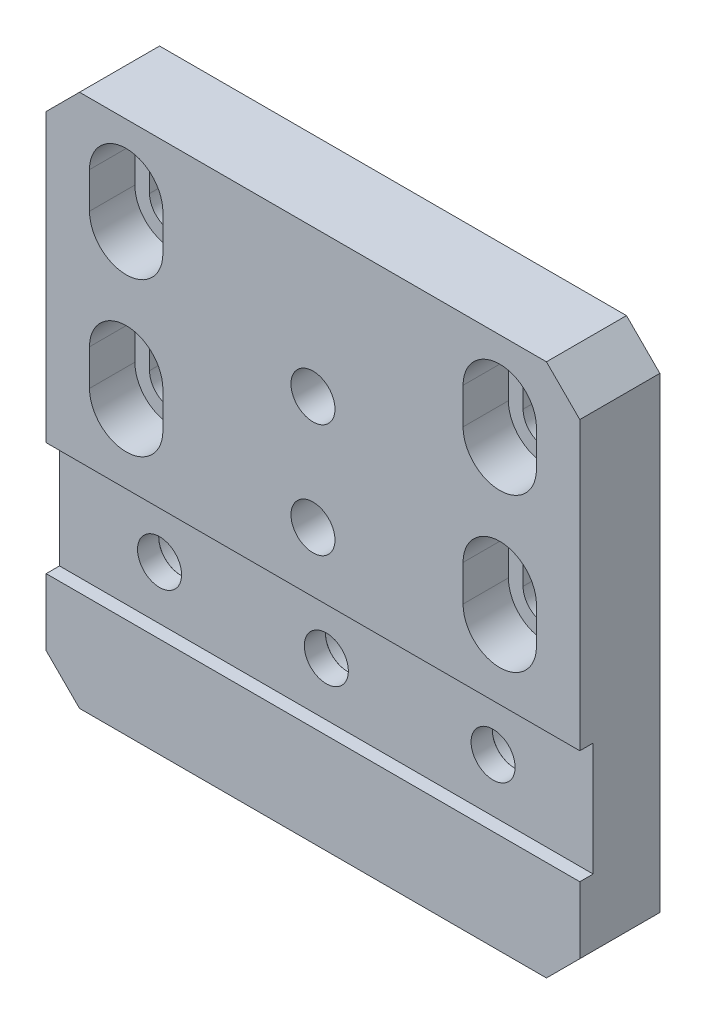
ISO-10303-21;
HEADER;
FILE_DESCRIPTION(('STEP AP214'),'2;1');
FILE_NAME('part.step','',(''),(''),'','','');
FILE_SCHEMA(('AUTOMOTIVE_DESIGN { 1 0 10303 214 1 1 1 1 }'));
ENDSEC;
DATA;
#1=APPLICATION_CONTEXT('core data for automotive mechanical design processes');
#2=APPLICATION_PROTOCOL_DEFINITION('international standard','automotive_design',2000,#1);
#3=PRODUCT_CONTEXT('',#1,'mechanical');
#4=PRODUCT('Part','Part','',(#3));
#5=PRODUCT_RELATED_PRODUCT_CATEGORY('part','',(#4));
#6=PRODUCT_DEFINITION_FORMATION('','',#4);
#7=PRODUCT_DEFINITION_CONTEXT('part definition',#1,'design');
#8=PRODUCT_DEFINITION('design','',#6,#7);
#9=PRODUCT_DEFINITION_SHAPE('','',#8);
#10=(LENGTH_UNIT() NAMED_UNIT(*) SI_UNIT(.MILLI.,.METRE.));
#11=(NAMED_UNIT(*) PLANE_ANGLE_UNIT() SI_UNIT($,.RADIAN.));
#12=(NAMED_UNIT(*) SI_UNIT($,.STERADIAN.) SOLID_ANGLE_UNIT());
#13=UNCERTAINTY_MEASURE_WITH_UNIT(LENGTH_MEASURE(1.E-05),#10,'distance_accuracy_value','');
#14=(GEOMETRIC_REPRESENTATION_CONTEXT(3) GLOBAL_UNCERTAINTY_ASSIGNED_CONTEXT((#13)) GLOBAL_UNIT_ASSIGNED_CONTEXT((#10,
#11,#12)) REPRESENTATION_CONTEXT('',''));
#15=CARTESIAN_POINT('',(0.,0.,0.));
#16=DIRECTION('',(0.,0.,1.));
#17=DIRECTION('',(1.,0.,0.));
#18=AXIS2_PLACEMENT_3D('',#15,#16,#17);
#19=CARTESIAN_POINT('',(0.,0.,12.));
#20=DIRECTION('',(0.,0.,1.));
#21=DIRECTION('',(1.,0.,0.));
#22=AXIS2_PLACEMENT_3D('',#19,#20,#21);
#23=PLANE('',#22);
#24=CARTESIAN_POINT('',(-28.,2.3,12.));
#25=DIRECTION('',(0.,0.,1.));
#26=DIRECTION('',(1.,0.,0.));
#27=AXIS2_PLACEMENT_3D('',#24,#25,#26);
#28=CIRCLE('',#27,5.5);
#29=CARTESIAN_POINT('',(-33.5,2.3,12.));
#30=VERTEX_POINT('',#29);
#31=CARTESIAN_POINT('',(-22.5,2.3,12.));
#32=VERTEX_POINT('',#31);
#33=EDGE_CURVE('E404',#30,#32,#28,.T.);
#34=ORIENTED_EDGE('',*,*,#33,.F.);
#35=DIRECTION('',(0.,-1.,0.));
#36=VECTOR('',#35,1.);
#37=CARTESIAN_POINT('',(-33.5,7.7,12.));
#38=LINE('',#37,#36);
#39=CARTESIAN_POINT('',(-33.5,7.7,12.));
#40=VERTEX_POINT('',#39);
#41=EDGE_CURVE('E354',#40,#30,#38,.T.);
#42=ORIENTED_EDGE('',*,*,#41,.F.);
#43=CARTESIAN_POINT('',(-28.,7.7,12.));
#44=DIRECTION('',(0.,0.,1.));
#45=DIRECTION('',(1.,0.,0.));
#46=AXIS2_PLACEMENT_3D('',#43,#44,#45);
#47=CIRCLE('',#46,5.5);
#48=CARTESIAN_POINT('',(-22.5,7.7,12.));
#49=VERTEX_POINT('',#48);
#50=EDGE_CURVE('E383',#49,#40,#47,.T.);
#51=ORIENTED_EDGE('',*,*,#50,.F.);
#52=DIRECTION('',(0.,-1.,0.));
#53=VECTOR('',#52,1.);
#54=CARTESIAN_POINT('',(-22.5,7.7,12.));
#55=LINE('',#54,#53);
#56=EDGE_CURVE('E371',#49,#32,#55,.T.);
#57=ORIENTED_EDGE('',*,*,#56,.T.);
#58=EDGE_LOOP('',(#34,#42,#51,#57));
#59=FACE_BOUND('',#58,.T.);
#60=CARTESIAN_POINT('',(28.,2.3,12.));
#61=DIRECTION('',(0.,0.,1.));
#62=DIRECTION('',(1.,0.,0.));
#63=AXIS2_PLACEMENT_3D('',#60,#61,#62);
#64=CIRCLE('',#63,5.5);
#65=CARTESIAN_POINT('',(22.5,2.3,12.));
#66=VERTEX_POINT('',#65);
#67=CARTESIAN_POINT('',(33.5,2.3,12.));
#68=VERTEX_POINT('',#67);
#69=EDGE_CURVE('E532',#66,#68,#64,.T.);
#70=ORIENTED_EDGE('',*,*,#69,.F.);
#71=DIRECTION('',(0.,-1.,0.));
#72=VECTOR('',#71,1.);
#73=CARTESIAN_POINT('',(22.5,7.7,12.));
#74=LINE('',#73,#72);
#75=CARTESIAN_POINT('',(22.5,7.7,12.));
#76=VERTEX_POINT('',#75);
#77=EDGE_CURVE('E482',#76,#66,#74,.T.);
#78=ORIENTED_EDGE('',*,*,#77,.F.);
#79=CARTESIAN_POINT('',(28.,7.7,12.));
#80=DIRECTION('',(0.,0.,1.));
#81=DIRECTION('',(1.,0.,0.));
#82=AXIS2_PLACEMENT_3D('',#79,#80,#81);
#83=CIRCLE('',#82,5.5);
#84=CARTESIAN_POINT('',(33.5,7.7,12.));
#85=VERTEX_POINT('',#84);
#86=EDGE_CURVE('E511',#85,#76,#83,.T.);
#87=ORIENTED_EDGE('',*,*,#86,.F.);
#88=DIRECTION('',(0.,-1.,0.));
#89=VECTOR('',#88,1.);
#90=CARTESIAN_POINT('',(33.5,7.7,12.));
#91=LINE('',#90,#89);
#92=EDGE_CURVE('E499',#85,#68,#91,.T.);
#93=ORIENTED_EDGE('',*,*,#92,.T.);
#94=EDGE_LOOP('',(#70,#78,#87,#93));
#95=FACE_BOUND('',#94,.T.);
#96=CARTESIAN_POINT('',(0.,1.,12.));
#97=DIRECTION('',(0.,0.,-1.));
#98=DIRECTION('',(-1.,0.,0.));
#99=AXIS2_PLACEMENT_3D('',#96,#97,#98);
#100=CIRCLE('',#99,3.3);
#101=CARTESIAN_POINT('',(-3.3,1.,12.));
#102=VERTEX_POINT('',#101);
#103=EDGE_CURVE('E609',#102,#102,#100,.T.);
#104=ORIENTED_EDGE('',*,*,#103,.T.);
#105=EDGE_LOOP('',(#104));
#106=FACE_BOUND('',#105,.T.);
#107=CARTESIAN_POINT('',(0.,18.,12.));
#108=DIRECTION('',(0.,0.,-1.));
#109=DIRECTION('',(-1.,0.,0.));
#110=AXIS2_PLACEMENT_3D('',#107,#108,#109);
#111=CIRCLE('',#110,3.3);
#112=CARTESIAN_POINT('',(-3.3,18.,12.));
#113=VERTEX_POINT('',#112);
#114=EDGE_CURVE('E627',#113,#113,#111,.T.);
#115=ORIENTED_EDGE('',*,*,#114,.T.);
#116=EDGE_LOOP('',(#115));
#117=FACE_BOUND('',#116,.T.);
#118=DIRECTION('',(0.,1.,0.));
#119=VECTOR('',#118,1.);
#120=CARTESIAN_POINT('',(40.,40.,12.));
#121=LINE('',#120,#119);
#122=CARTESIAN_POINT('',(40.,-8.,12.));
#123=VERTEX_POINT('',#122);
#124=CARTESIAN_POINT('',(40.,35.,12.));
#125=VERTEX_POINT('',#124);
#126=EDGE_CURVE('E661',#123,#125,#121,.T.);
#127=ORIENTED_EDGE('',*,*,#126,.T.);
#128=DIRECTION('',(0.707106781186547,-0.707106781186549,0.));
#129=VECTOR('',#128,1.);
#130=CARTESIAN_POINT('',(37.5,37.5,12.));
#131=LINE('',#130,#129);
#132=CARTESIAN_POINT('',(35.,40.,12.));
#133=VERTEX_POINT('',#132);
#134=EDGE_CURVE('E705',#125,#133,#131,.F.);
#135=ORIENTED_EDGE('',*,*,#134,.T.);
#136=DIRECTION('',(-1.,0.,0.));
#137=VECTOR('',#136,1.);
#138=CARTESIAN_POINT('',(-40.,40.,12.));
#139=LINE('',#138,#137);
#140=CARTESIAN_POINT('',(-35.,40.,12.));
#141=VERTEX_POINT('',#140);
#142=EDGE_CURVE('E660',#133,#141,#139,.T.);
#143=ORIENTED_EDGE('',*,*,#142,.T.);
#144=DIRECTION('',(0.70710678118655,0.707106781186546,0.));
#145=VECTOR('',#144,1.);
#146=CARTESIAN_POINT('',(-37.5,37.5,12.));
#147=LINE('',#146,#145);
#148=CARTESIAN_POINT('',(-40.,35.,12.));
#149=VERTEX_POINT('',#148);
#150=EDGE_CURVE('E703',#141,#149,#147,.F.);
#151=ORIENTED_EDGE('',*,*,#150,.T.);
#152=DIRECTION('',(0.,-1.,0.));
#153=VECTOR('',#152,1.);
#154=CARTESIAN_POINT('',(-40.,40.,12.));
#155=LINE('',#154,#153);
#156=CARTESIAN_POINT('',(-40.,-8.,12.));
#157=VERTEX_POINT('',#156);
#158=EDGE_CURVE('E665',#149,#157,#155,.T.);
#159=ORIENTED_EDGE('',*,*,#158,.T.);
#160=DIRECTION('',(1.,0.,0.));
#161=VECTOR('',#160,1.);
#162=CARTESIAN_POINT('',(-40.,-8.,12.));
#163=LINE('',#162,#161);
#164=EDGE_CURVE('E648',#157,#123,#163,.T.);
#165=ORIENTED_EDGE('',*,*,#164,.T.);
#166=EDGE_LOOP('',(#127,#135,#143,#151,#159,#165));
#167=FACE_BOUND('',#166,.T.);
#168=CARTESIAN_POINT('',(28.,30.7,12.));
#169=DIRECTION('',(0.,0.,1.));
#170=DIRECTION('',(1.,0.,0.));
#171=AXIS2_PLACEMENT_3D('',#168,#169,#170);
#172=CIRCLE('',#171,5.5);
#173=CARTESIAN_POINT('',(33.5,30.7,12.));
#174=VERTEX_POINT('',#173);
#175=CARTESIAN_POINT('',(22.5,30.7,12.));
#176=VERTEX_POINT('',#175);
#177=EDGE_CURVE('E447',#174,#176,#172,.T.);
#178=ORIENTED_EDGE('',*,*,#177,.F.);
#179=DIRECTION('',(0.,-1.,0.));
#180=VECTOR('',#179,1.);
#181=CARTESIAN_POINT('',(33.5,30.7,12.));
#182=LINE('',#181,#180);
#183=CARTESIAN_POINT('',(33.5,25.3,12.));
#184=VERTEX_POINT('',#183);
#185=EDGE_CURVE('E435',#174,#184,#182,.T.);
#186=ORIENTED_EDGE('',*,*,#185,.T.);
#187=CARTESIAN_POINT('',(28.,25.3,12.));
#188=DIRECTION('',(0.,0.,1.));
#189=DIRECTION('',(1.,0.,0.));
#190=AXIS2_PLACEMENT_3D('',#187,#188,#189);
#191=CIRCLE('',#190,5.5);
#192=CARTESIAN_POINT('',(22.5,25.3,12.));
#193=VERTEX_POINT('',#192);
#194=EDGE_CURVE('E468',#193,#184,#191,.T.);
#195=ORIENTED_EDGE('',*,*,#194,.F.);
#196=DIRECTION('',(0.,-1.,0.));
#197=VECTOR('',#196,1.);
#198=CARTESIAN_POINT('',(22.5,30.7,12.));
#199=LINE('',#198,#197);
#200=EDGE_CURVE('E418',#176,#193,#199,.T.);
#201=ORIENTED_EDGE('',*,*,#200,.F.);
#202=EDGE_LOOP('',(#178,#186,#195,#201));
#203=FACE_BOUND('',#202,.T.);
#204=CARTESIAN_POINT('',(-28.,30.7,12.));
#205=DIRECTION('',(0.,0.,1.));
#206=DIRECTION('',(1.,0.,0.));
#207=AXIS2_PLACEMENT_3D('',#204,#205,#206);
#208=CIRCLE('',#207,5.5);
#209=CARTESIAN_POINT('',(-22.5,30.7,12.));
#210=VERTEX_POINT('',#209);
#211=CARTESIAN_POINT('',(-33.5,30.7,12.));
#212=VERTEX_POINT('',#211);
#213=EDGE_CURVE('E314',#210,#212,#208,.T.);
#214=ORIENTED_EDGE('',*,*,#213,.F.);
#215=DIRECTION('',(0.,-1.,0.));
#216=VECTOR('',#215,1.);
#217=CARTESIAN_POINT('',(-22.5,30.7,12.));
#218=LINE('',#217,#216);
#219=CARTESIAN_POINT('',(-22.5,25.3,12.));
#220=VERTEX_POINT('',#219);
#221=EDGE_CURVE('E298',#210,#220,#218,.T.);
#222=ORIENTED_EDGE('',*,*,#221,.T.);
#223=CARTESIAN_POINT('',(-28.,25.3,12.));
#224=DIRECTION('',(0.,0.,1.));
#225=DIRECTION('',(1.,0.,0.));
#226=AXIS2_PLACEMENT_3D('',#223,#224,#225);
#227=CIRCLE('',#226,5.5);
#228=CARTESIAN_POINT('',(-33.5,25.3,12.));
#229=VERTEX_POINT('',#228);
#230=EDGE_CURVE('E340',#229,#220,#227,.T.);
#231=ORIENTED_EDGE('',*,*,#230,.F.);
#232=DIRECTION('',(0.,-1.,0.));
#233=VECTOR('',#232,1.);
#234=CARTESIAN_POINT('',(-33.5,30.7,12.));
#235=LINE('',#234,#233);
#236=EDGE_CURVE('E321',#212,#229,#235,.T.);
#237=ORIENTED_EDGE('',*,*,#236,.F.);
#238=EDGE_LOOP('',(#214,#222,#231,#237));
#239=FACE_BOUND('',#238,.T.);
#240=ADVANCED_FACE('F16',(#59,#95,#106,#117,#167,#203,#239),#23,.T.);
#241=CARTESIAN_POINT('',(0.,0.,0.));
#242=DIRECTION('',(0.,0.,1.));
#243=DIRECTION('',(1.,0.,0.));
#244=AXIS2_PLACEMENT_3D('',#241,#242,#243);
#245=PLANE('',#244);
#246=DIRECTION('',(0.,-1.,0.));
#247=VECTOR('',#246,1.);
#248=CARTESIAN_POINT('',(-31.3,30.7,0.));
#249=LINE('',#248,#247);
#250=CARTESIAN_POINT('',(-31.3,30.7,0.));
#251=VERTEX_POINT('',#250);
#252=CARTESIAN_POINT('',(-31.3,25.3,0.));
#253=VERTEX_POINT('',#252);
#254=EDGE_CURVE('E1621',#251,#253,#249,.T.);
#255=ORIENTED_EDGE('',*,*,#254,.T.);
#256=CARTESIAN_POINT('',(-28.,25.3,0.));
#257=DIRECTION('',(0.,0.,1.));
#258=DIRECTION('',(1.,0.,0.));
#259=AXIS2_PLACEMENT_3D('',#256,#257,#258);
#260=CIRCLE('',#259,3.3);
#261=CARTESIAN_POINT('',(-24.7,25.3,0.));
#262=VERTEX_POINT('',#261);
#263=EDGE_CURVE('E348',#253,#262,#260,.T.);
#264=ORIENTED_EDGE('',*,*,#263,.T.);
#265=DIRECTION('',(0.,-1.,0.));
#266=VECTOR('',#265,1.);
#267=CARTESIAN_POINT('',(-24.7,30.7,0.));
#268=LINE('',#267,#266);
#269=CARTESIAN_POINT('',(-24.7,30.7,0.));
#270=VERTEX_POINT('',#269);
#271=EDGE_CURVE('E1620',#270,#262,#268,.T.);
#272=ORIENTED_EDGE('',*,*,#271,.F.);
#273=CARTESIAN_POINT('',(-28.,30.7,0.));
#274=DIRECTION('',(0.,0.,1.));
#275=DIRECTION('',(1.,0.,0.));
#276=AXIS2_PLACEMENT_3D('',#273,#274,#275);
#277=CIRCLE('',#276,3.3);
#278=EDGE_CURVE('E330',#270,#251,#277,.T.);
#279=ORIENTED_EDGE('',*,*,#278,.T.);
#280=EDGE_LOOP('',(#255,#264,#272,#279));
#281=FACE_BOUND('',#280,.T.);
#282=DIRECTION('',(0.,-1.,0.));
#283=VECTOR('',#282,1.);
#284=CARTESIAN_POINT('',(31.3,7.7,0.));
#285=LINE('',#284,#283);
#286=CARTESIAN_POINT('',(31.3,7.7,0.));
#287=VERTEX_POINT('',#286);
#288=CARTESIAN_POINT('',(31.3,2.3,0.));
#289=VERTEX_POINT('',#288);
#290=EDGE_CURVE('E491',#287,#289,#285,.T.);
#291=ORIENTED_EDGE('',*,*,#290,.F.);
#292=CARTESIAN_POINT('',(28.,7.7,0.));
#293=DIRECTION('',(0.,0.,1.));
#294=DIRECTION('',(1.,0.,0.));
#295=AXIS2_PLACEMENT_3D('',#292,#293,#294);
#296=CIRCLE('',#295,3.3);
#297=CARTESIAN_POINT('',(24.7,7.7,0.));
#298=VERTEX_POINT('',#297);
#299=EDGE_CURVE('E519',#287,#298,#296,.T.);
#300=ORIENTED_EDGE('',*,*,#299,.T.);
#301=DIRECTION('',(0.,-1.,0.));
#302=VECTOR('',#301,1.);
#303=CARTESIAN_POINT('',(24.7,7.7,0.));
#304=LINE('',#303,#302);
#305=CARTESIAN_POINT('',(24.7,2.3,0.));
#306=VERTEX_POINT('',#305);
#307=EDGE_CURVE('E488',#298,#306,#304,.T.);
#308=ORIENTED_EDGE('',*,*,#307,.T.);
#309=CARTESIAN_POINT('',(28.,2.3,0.));
#310=DIRECTION('',(0.,0.,1.));
#311=DIRECTION('',(1.,0.,0.));
#312=AXIS2_PLACEMENT_3D('',#309,#310,#311);
#313=CIRCLE('',#312,3.3);
#314=EDGE_CURVE('E540',#306,#289,#313,.T.);
#315=ORIENTED_EDGE('',*,*,#314,.T.);
#316=EDGE_LOOP('',(#291,#300,#308,#315));
#317=FACE_BOUND('',#316,.T.);
#318=CARTESIAN_POINT('',(25.,-17.,0.));
#319=DIRECTION('',(0.,0.,-1.));
#320=DIRECTION('',(-1.,0.,0.));
#321=AXIS2_PLACEMENT_3D('',#318,#319,#320);
#322=CIRCLE('',#321,5.525);
#323=CARTESIAN_POINT('',(19.475,-17.,0.));
#324=VERTEX_POINT('',#323);
#325=EDGE_CURVE('E546',#324,#324,#322,.T.);
#326=ORIENTED_EDGE('',*,*,#325,.F.);
#327=EDGE_LOOP('',(#326));
#328=FACE_BOUND('',#327,.T.);
#329=CARTESIAN_POINT('',(-25.,-17.,0.));
#330=DIRECTION('',(0.,0.,-1.));
#331=DIRECTION('',(-1.,0.,0.));
#332=AXIS2_PLACEMENT_3D('',#329,#330,#331);
#333=CIRCLE('',#332,5.525);
#334=CARTESIAN_POINT('',(-30.525,-17.,0.));
#335=VERTEX_POINT('',#334);
#336=EDGE_CURVE('E562',#335,#335,#333,.T.);
#337=ORIENTED_EDGE('',*,*,#336,.F.);
#338=EDGE_LOOP('',(#337));
#339=FACE_BOUND('',#338,.T.);
#340=CARTESIAN_POINT('',(0.,-17.,0.));
#341=DIRECTION('',(0.,0.,-1.));
#342=DIRECTION('',(-1.,0.,0.));
#343=AXIS2_PLACEMENT_3D('',#340,#341,#342);
#344=CIRCLE('',#343,5.525);
#345=CARTESIAN_POINT('',(-5.525,-17.,0.));
#346=VERTEX_POINT('',#345);
#347=EDGE_CURVE('E578',#346,#346,#344,.T.);
#348=ORIENTED_EDGE('',*,*,#347,.F.);
#349=EDGE_LOOP('',(#348));
#350=FACE_BOUND('',#349,.T.);
#351=CARTESIAN_POINT('',(0.,1.,0.));
#352=DIRECTION('',(0.,0.,-1.));
#353=DIRECTION('',(-1.,0.,0.));
#354=AXIS2_PLACEMENT_3D('',#351,#352,#353);
#355=CIRCLE('',#354,5.525);
#356=CARTESIAN_POINT('',(-5.525,1.,0.));
#357=VERTEX_POINT('',#356);
#358=EDGE_CURVE('E594',#357,#357,#355,.T.);
#359=ORIENTED_EDGE('',*,*,#358,.F.);
#360=EDGE_LOOP('',(#359));
#361=FACE_BOUND('',#360,.T.);
#362=CARTESIAN_POINT('',(0.,18.,0.));
#363=DIRECTION('',(0.,0.,-1.));
#364=DIRECTION('',(-1.,0.,0.));
#365=AXIS2_PLACEMENT_3D('',#362,#363,#364);
#366=CIRCLE('',#365,5.525);
#367=CARTESIAN_POINT('',(-5.525,18.,0.));
#368=VERTEX_POINT('',#367);
#369=EDGE_CURVE('E612',#368,#368,#366,.T.);
#370=ORIENTED_EDGE('',*,*,#369,.F.);
#371=EDGE_LOOP('',(#370));
#372=FACE_BOUND('',#371,.T.);
#373=DIRECTION('',(-1.,0.,0.));
#374=VECTOR('',#373,1.);
#375=CARTESIAN_POINT('',(-40.,40.,0.));
#376=LINE('',#375,#374);
#377=CARTESIAN_POINT('',(35.,40.,0.));
#378=VERTEX_POINT('',#377);
#379=CARTESIAN_POINT('',(-35.,40.,0.));
#380=VERTEX_POINT('',#379);
#381=EDGE_CURVE('E672',#378,#380,#376,.T.);
#382=ORIENTED_EDGE('',*,*,#381,.F.);
#383=DIRECTION('',(-0.707106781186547,0.707106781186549,0.));
#384=VECTOR('',#383,1.);
#385=CARTESIAN_POINT('',(35.,40.,0.));
#386=LINE('',#385,#384);
#387=CARTESIAN_POINT('',(40.,35.,0.));
#388=VERTEX_POINT('',#387);
#389=EDGE_CURVE('E696',#378,#388,#386,.F.);
#390=ORIENTED_EDGE('',*,*,#389,.T.);
#391=DIRECTION('',(0.,1.,0.));
#392=VECTOR('',#391,1.);
#393=CARTESIAN_POINT('',(40.,40.,0.));
#394=LINE('',#393,#392);
#395=CARTESIAN_POINT('',(40.,-35.,0.));
#396=VERTEX_POINT('',#395);
#397=EDGE_CURVE('E651',#396,#388,#394,.T.);
#398=ORIENTED_EDGE('',*,*,#397,.F.);
#399=DIRECTION('',(0.70710678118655,0.707106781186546,0.));
#400=VECTOR('',#399,1.);
#401=CARTESIAN_POINT('',(40.,-35.,0.));
#402=LINE('',#401,#400);
#403=CARTESIAN_POINT('',(35.,-40.,0.));
#404=VERTEX_POINT('',#403);
#405=EDGE_CURVE('E690',#396,#404,#402,.F.);
#406=ORIENTED_EDGE('',*,*,#405,.T.);
#407=DIRECTION('',(1.,0.,0.));
#408=VECTOR('',#407,1.);
#409=CARTESIAN_POINT('',(-40.,-40.,0.));
#410=LINE('',#409,#408);
#411=CARTESIAN_POINT('',(-35.,-40.,0.));
#412=VERTEX_POINT('',#411);
#413=EDGE_CURVE('E678',#412,#404,#410,.T.);
#414=ORIENTED_EDGE('',*,*,#413,.F.);
#415=DIRECTION('',(0.707106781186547,-0.707106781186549,0.));
#416=VECTOR('',#415,1.);
#417=CARTESIAN_POINT('',(-35.,-40.,0.));
#418=LINE('',#417,#416);
#419=CARTESIAN_POINT('',(-40.,-35.,0.));
#420=VERTEX_POINT('',#419);
#421=EDGE_CURVE('E692',#412,#420,#418,.F.);
#422=ORIENTED_EDGE('',*,*,#421,.T.);
#423=DIRECTION('',(0.,-1.,0.));
#424=VECTOR('',#423,1.);
#425=CARTESIAN_POINT('',(-40.,40.,0.));
#426=LINE('',#425,#424);
#427=CARTESIAN_POINT('',(-40.,35.,0.));
#428=VERTEX_POINT('',#427);
#429=EDGE_CURVE('E675',#428,#420,#426,.T.);
#430=ORIENTED_EDGE('',*,*,#429,.F.);
#431=DIRECTION('',(-0.70710678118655,-0.707106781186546,0.));
#432=VECTOR('',#431,1.);
#433=CARTESIAN_POINT('',(-40.,35.,0.));
#434=LINE('',#433,#432);
#435=EDGE_CURVE('E694',#428,#380,#434,.F.);
#436=ORIENTED_EDGE('',*,*,#435,.T.);
#437=EDGE_LOOP('',(#382,#390,#398,#406,#414,#422,#430,#436));
#438=FACE_BOUND('',#437,.T.);
#439=DIRECTION('',(0.,-1.,0.));
#440=VECTOR('',#439,1.);
#441=CARTESIAN_POINT('',(24.7,30.7,0.));
#442=LINE('',#441,#440);
#443=CARTESIAN_POINT('',(24.7,30.7,0.));
#444=VERTEX_POINT('',#443);
#445=CARTESIAN_POINT('',(24.7,25.3,0.));
#446=VERTEX_POINT('',#445);
#447=EDGE_CURVE('E424',#444,#446,#442,.T.);
#448=ORIENTED_EDGE('',*,*,#447,.T.);
#449=CARTESIAN_POINT('',(28.,25.3,0.));
#450=DIRECTION('',(0.,0.,1.));
#451=DIRECTION('',(1.,0.,0.));
#452=AXIS2_PLACEMENT_3D('',#449,#450,#451);
#453=CIRCLE('',#452,3.3);
#454=CARTESIAN_POINT('',(31.3,25.3,0.));
#455=VERTEX_POINT('',#454);
#456=EDGE_CURVE('E476',#446,#455,#453,.T.);
#457=ORIENTED_EDGE('',*,*,#456,.T.);
#458=DIRECTION('',(0.,-1.,0.));
#459=VECTOR('',#458,1.);
#460=CARTESIAN_POINT('',(31.3,30.7,0.));
#461=LINE('',#460,#459);
#462=CARTESIAN_POINT('',(31.3,30.7,0.));
#463=VERTEX_POINT('',#462);
#464=EDGE_CURVE('E427',#463,#455,#461,.T.);
#465=ORIENTED_EDGE('',*,*,#464,.F.);
#466=CARTESIAN_POINT('',(28.,30.7,0.));
#467=DIRECTION('',(0.,0.,1.));
#468=DIRECTION('',(1.,0.,0.));
#469=AXIS2_PLACEMENT_3D('',#466,#467,#468);
#470=CIRCLE('',#469,3.3);
#471=EDGE_CURVE('E455',#463,#444,#470,.T.);
#472=ORIENTED_EDGE('',*,*,#471,.T.);
#473=EDGE_LOOP('',(#448,#457,#465,#472));
#474=FACE_BOUND('',#473,.T.);
#475=DIRECTION('',(0.,-1.,0.));
#476=VECTOR('',#475,1.);
#477=CARTESIAN_POINT('',(-24.7,7.7,0.));
#478=LINE('',#477,#476);
#479=CARTESIAN_POINT('',(-24.7,7.7,0.));
#480=VERTEX_POINT('',#479);
#481=CARTESIAN_POINT('',(-24.7,2.3,0.));
#482=VERTEX_POINT('',#481);
#483=EDGE_CURVE('E363',#480,#482,#478,.T.);
#484=ORIENTED_EDGE('',*,*,#483,.F.);
#485=CARTESIAN_POINT('',(-28.,7.7,0.));
#486=DIRECTION('',(0.,0.,1.));
#487=DIRECTION('',(1.,0.,0.));
#488=AXIS2_PLACEMENT_3D('',#485,#486,#487);
#489=CIRCLE('',#488,3.3);
#490=CARTESIAN_POINT('',(-31.3,7.7,0.));
#491=VERTEX_POINT('',#490);
#492=EDGE_CURVE('E392',#480,#491,#489,.T.);
#493=ORIENTED_EDGE('',*,*,#492,.T.);
#494=DIRECTION('',(0.,-1.,0.));
#495=VECTOR('',#494,1.);
#496=CARTESIAN_POINT('',(-31.3,7.7,0.));
#497=LINE('',#496,#495);
#498=CARTESIAN_POINT('',(-31.3,2.3,0.));
#499=VERTEX_POINT('',#498);
#500=EDGE_CURVE('E360',#491,#499,#497,.T.);
#501=ORIENTED_EDGE('',*,*,#500,.T.);
#502=CARTESIAN_POINT('',(-28.,2.3,0.));
#503=DIRECTION('',(0.,0.,1.));
#504=DIRECTION('',(1.,0.,0.));
#505=AXIS2_PLACEMENT_3D('',#502,#503,#504);
#506=CIRCLE('',#505,3.3);
#507=EDGE_CURVE('E412',#499,#482,#506,.T.);
#508=ORIENTED_EDGE('',*,*,#507,.T.);
#509=EDGE_LOOP('',(#484,#493,#501,#508));
#510=FACE_BOUND('',#509,.T.);
#511=ADVANCED_FACE('F729',(#281,#317,#328,#339,#350,#361,#372,#438,#474,#510),#245,.F.);
#512=CARTESIAN_POINT('',(40.,40.,12.));
#513=DIRECTION('',(-1.,0.,0.));
#514=DIRECTION('',(0.,-1.,0.));
#515=AXIS2_PLACEMENT_3D('',#512,#513,#514);
#516=PLANE('',#515);
#517=ORIENTED_EDGE('',*,*,#397,.T.);
#518=DIRECTION('',(0.,0.,1.));
#519=VECTOR('',#518,1.);
#520=CARTESIAN_POINT('',(40.,35.,12.));
#521=LINE('',#520,#519);
#522=EDGE_CURVE('E701',#388,#125,#521,.T.);
#523=ORIENTED_EDGE('',*,*,#522,.T.);
#524=ORIENTED_EDGE('',*,*,#126,.F.);
#525=DIRECTION('',(0.,0.,1.));
#526=VECTOR('',#525,1.);
#527=CARTESIAN_POINT('',(40.,-8.,12.));
#528=LINE('',#527,#526);
#529=CARTESIAN_POINT('',(40.,-8.,10.));
#530=VERTEX_POINT('',#529);
#531=EDGE_CURVE('E635',#530,#123,#528,.T.);
#532=ORIENTED_EDGE('',*,*,#531,.F.);
#533=DIRECTION('',(0.,1.,0.));
#534=VECTOR('',#533,1.);
#535=CARTESIAN_POINT('',(40.,-25.,10.));
#536=LINE('',#535,#534);
#537=CARTESIAN_POINT('',(40.,-25.,10.));
#538=VERTEX_POINT('',#537);
#539=EDGE_CURVE('E644',#538,#530,#536,.T.);
#540=ORIENTED_EDGE('',*,*,#539,.F.);
#541=DIRECTION('',(0.,0.,-1.));
#542=VECTOR('',#541,1.);
#543=CARTESIAN_POINT('',(40.,-25.,12.));
#544=LINE('',#543,#542);
#545=CARTESIAN_POINT('',(40.,-25.,12.));
#546=VERTEX_POINT('',#545);
#547=EDGE_CURVE('E630',#546,#538,#544,.T.);
#548=ORIENTED_EDGE('',*,*,#547,.F.);
#549=CARTESIAN_POINT('',(40.,-35.,12.));
#550=VERTEX_POINT('',#549);
#551=EDGE_CURVE('E658',#550,#546,#121,.T.);
#552=ORIENTED_EDGE('',*,*,#551,.F.);
#553=DIRECTION('',(0.,0.,-1.));
#554=VECTOR('',#553,1.);
#555=CARTESIAN_POINT('',(40.,-35.,12.));
#556=LINE('',#555,#554);
#557=EDGE_CURVE('E698',#550,#396,#556,.T.);
#558=ORIENTED_EDGE('',*,*,#557,.T.);
#559=EDGE_LOOP('',(#517,#523,#524,#532,#540,#548,#552,#558));
#560=FACE_BOUND('',#559,.T.);
#561=ADVANCED_FACE('F723',(#560),#516,.F.);
#562=CARTESIAN_POINT('',(-40.,40.,12.));
#563=DIRECTION('',(0.,-1.,0.));
#564=DIRECTION('',(0.,0.,-1.));
#565=AXIS2_PLACEMENT_3D('',#562,#563,#564);
#566=PLANE('',#565);
#567=ORIENTED_EDGE('',*,*,#142,.F.);
#568=DIRECTION('',(0.,0.,-1.));
#569=VECTOR('',#568,1.);
#570=CARTESIAN_POINT('',(35.,40.,12.));
#571=LINE('',#570,#569);
#572=EDGE_CURVE('E687',#133,#378,#571,.T.);
#573=ORIENTED_EDGE('',*,*,#572,.T.);
#574=ORIENTED_EDGE('',*,*,#381,.T.);
#575=DIRECTION('',(0.,0.,1.));
#576=VECTOR('',#575,1.);
#577=CARTESIAN_POINT('',(-35.,40.,12.));
#578=LINE('',#577,#576);
#579=EDGE_CURVE('E669',#380,#141,#578,.T.);
#580=ORIENTED_EDGE('',*,*,#579,.T.);
#581=EDGE_LOOP('',(#567,#573,#574,#580));
#582=FACE_BOUND('',#581,.T.);
#583=ADVANCED_FACE('F748',(#582),#566,.F.);
#584=CARTESIAN_POINT('',(-40.,40.,12.));
#585=DIRECTION('',(1.,0.,0.));
#586=DIRECTION('',(0.,1.,0.));
#587=AXIS2_PLACEMENT_3D('',#584,#585,#586);
#588=PLANE('',#587);
#589=ORIENTED_EDGE('',*,*,#158,.F.);
#590=DIRECTION('',(0.,0.,-1.));
#591=VECTOR('',#590,1.);
#592=CARTESIAN_POINT('',(-40.,35.,12.));
#593=LINE('',#592,#591);
#594=EDGE_CURVE('E709',#149,#428,#593,.T.);
#595=ORIENTED_EDGE('',*,*,#594,.T.);
#596=ORIENTED_EDGE('',*,*,#429,.T.);
#597=DIRECTION('',(0.,0.,1.));
#598=VECTOR('',#597,1.);
#599=CARTESIAN_POINT('',(-40.,-35.,12.));
#600=LINE('',#599,#598);
#601=CARTESIAN_POINT('',(-40.,-35.,12.));
#602=VERTEX_POINT('',#601);
#603=EDGE_CURVE('E707',#420,#602,#600,.T.);
#604=ORIENTED_EDGE('',*,*,#603,.T.);
#605=CARTESIAN_POINT('',(-40.,-25.,12.));
#606=VERTEX_POINT('',#605);
#607=EDGE_CURVE('E664',#606,#602,#155,.T.);
#608=ORIENTED_EDGE('',*,*,#607,.F.);
#609=DIRECTION('',(0.,0.,-1.));
#610=VECTOR('',#609,1.);
#611=CARTESIAN_POINT('',(-40.,-25.,12.));
#612=LINE('',#611,#610);
#613=CARTESIAN_POINT('',(-40.,-25.,10.));
#614=VERTEX_POINT('',#613);
#615=EDGE_CURVE('E631',#606,#614,#612,.T.);
#616=ORIENTED_EDGE('',*,*,#615,.T.);
#617=DIRECTION('',(0.,1.,0.));
#618=VECTOR('',#617,1.);
#619=CARTESIAN_POINT('',(-40.,-25.,10.));
#620=LINE('',#619,#618);
#621=CARTESIAN_POINT('',(-40.,-8.,10.));
#622=VERTEX_POINT('',#621);
#623=EDGE_CURVE('E634',#614,#622,#620,.T.);
#624=ORIENTED_EDGE('',*,*,#623,.T.);
#625=DIRECTION('',(0.,0.,1.));
#626=VECTOR('',#625,1.);
#627=CARTESIAN_POINT('',(-40.,-8.,12.));
#628=LINE('',#627,#626);
#629=EDGE_CURVE('E638',#622,#157,#628,.T.);
#630=ORIENTED_EDGE('',*,*,#629,.T.);
#631=EDGE_LOOP('',(#589,#595,#596,#604,#608,#616,#624,#630));
#632=FACE_BOUND('',#631,.T.);
#633=ADVANCED_FACE('F739',(#632),#588,.F.);
#634=CARTESIAN_POINT('',(-40.,-40.,12.));
#635=DIRECTION('',(0.,1.,0.));
#636=DIRECTION('',(0.,0.,1.));
#637=AXIS2_PLACEMENT_3D('',#634,#635,#636);
#638=PLANE('',#637);
#639=DIRECTION('',(1.,0.,0.));
#640=VECTOR('',#639,1.);
#641=CARTESIAN_POINT('',(-40.,-40.,12.));
#642=LINE('',#641,#640);
#643=CARTESIAN_POINT('',(-35.,-40.,12.));
#644=VERTEX_POINT('',#643);
#645=CARTESIAN_POINT('',(35.,-40.,12.));
#646=VERTEX_POINT('',#645);
#647=EDGE_CURVE('E667',#644,#646,#642,.T.);
#648=ORIENTED_EDGE('',*,*,#647,.F.);
#649=DIRECTION('',(0.,0.,-1.));
#650=VECTOR('',#649,1.);
#651=CARTESIAN_POINT('',(-35.,-40.,12.));
#652=LINE('',#651,#650);
#653=EDGE_CURVE('E713',#644,#412,#652,.T.);
#654=ORIENTED_EDGE('',*,*,#653,.T.);
#655=ORIENTED_EDGE('',*,*,#413,.T.);
#656=DIRECTION('',(0.,0.,1.));
#657=VECTOR('',#656,1.);
#658=CARTESIAN_POINT('',(35.,-40.,12.));
#659=LINE('',#658,#657);
#660=EDGE_CURVE('E31',#404,#646,#659,.T.);
#661=ORIENTED_EDGE('',*,*,#660,.T.);
#662=EDGE_LOOP('',(#648,#654,#655,#661));
#663=FACE_BOUND('',#662,.T.);
#664=ADVANCED_FACE('F731',(#663),#638,.F.);
#665=ORIENTED_EDGE('',*,*,#607,.T.);
#666=DIRECTION('',(-0.707106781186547,0.707106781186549,0.));
#667=VECTOR('',#666,1.);
#668=CARTESIAN_POINT('',(-37.5,-37.5,12.));
#669=LINE('',#668,#667);
#670=EDGE_CURVE('E11',#602,#644,#669,.F.);
#671=ORIENTED_EDGE('',*,*,#670,.T.);
#672=ORIENTED_EDGE('',*,*,#647,.T.);
#673=DIRECTION('',(-0.70710678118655,-0.707106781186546,0.));
#674=VECTOR('',#673,1.);
#675=CARTESIAN_POINT('',(37.5,-37.5,12.));
#676=LINE('',#675,#674);
#677=EDGE_CURVE('E24',#646,#550,#676,.F.);
#678=ORIENTED_EDGE('',*,*,#677,.T.);
#679=ORIENTED_EDGE('',*,*,#551,.T.);
#680=DIRECTION('',(1.,0.,0.));
#681=VECTOR('',#680,1.);
#682=CARTESIAN_POINT('',(-40.,-25.,12.));
#683=LINE('',#682,#681);
#684=EDGE_CURVE('E641',#606,#546,#683,.T.);
#685=ORIENTED_EDGE('',*,*,#684,.F.);
#686=EDGE_LOOP('',(#665,#671,#672,#678,#679,#685));
#687=FACE_BOUND('',#686,.T.);
#688=ADVANCED_FACE('F717',(#687),#23,.T.);
#689=CARTESIAN_POINT('',(-40.,-8.,12.));
#690=DIRECTION('',(0.,1.,0.));
#691=DIRECTION('',(-1.,0.,0.));
#692=AXIS2_PLACEMENT_3D('',#689,#690,#691);
#693=PLANE('',#692);
#694=ORIENTED_EDGE('',*,*,#531,.T.);
#695=ORIENTED_EDGE('',*,*,#164,.F.);
#696=ORIENTED_EDGE('',*,*,#629,.F.);
#697=DIRECTION('',(1.,0.,0.));
#698=VECTOR('',#697,1.);
#699=CARTESIAN_POINT('',(-40.,-8.,10.));
#700=LINE('',#699,#698);
#701=EDGE_CURVE('E652',#622,#530,#700,.T.);
#702=ORIENTED_EDGE('',*,*,#701,.T.);
#703=EDGE_LOOP('',(#694,#695,#696,#702));
#704=FACE_BOUND('',#703,.T.);
#705=ADVANCED_FACE('F762',(#704),#693,.F.);
#706=CARTESIAN_POINT('',(-40.,-25.,10.));
#707=DIRECTION('',(0.,0.,-1.));
#708=DIRECTION('',(-1.,0.,0.));
#709=AXIS2_PLACEMENT_3D('',#706,#707,#708);
#710=PLANE('',#709);
#711=CARTESIAN_POINT('',(25.,-17.,10.));
#712=DIRECTION('',(0.,0.,-1.));
#713=DIRECTION('',(-1.,0.,0.));
#714=AXIS2_PLACEMENT_3D('',#711,#712,#713);
#715=CIRCLE('',#714,3.3);
#716=CARTESIAN_POINT('',(21.7,-17.,10.));
#717=VERTEX_POINT('',#716);
#718=EDGE_CURVE('E561',#717,#717,#715,.T.);
#719=ORIENTED_EDGE('',*,*,#718,.T.);
#720=EDGE_LOOP('',(#719));
#721=FACE_BOUND('',#720,.T.);
#722=CARTESIAN_POINT('',(-25.,-17.,10.));
#723=DIRECTION('',(0.,0.,-1.));
#724=DIRECTION('',(-1.,0.,0.));
#725=AXIS2_PLACEMENT_3D('',#722,#723,#724);
#726=CIRCLE('',#725,3.3);
#727=CARTESIAN_POINT('',(-28.3,-17.,10.));
#728=VERTEX_POINT('',#727);
#729=EDGE_CURVE('E577',#728,#728,#726,.T.);
#730=ORIENTED_EDGE('',*,*,#729,.T.);
#731=EDGE_LOOP('',(#730));
#732=FACE_BOUND('',#731,.T.);
#733=CARTESIAN_POINT('',(0.,-17.,10.));
#734=DIRECTION('',(0.,0.,-1.));
#735=DIRECTION('',(-1.,0.,0.));
#736=AXIS2_PLACEMENT_3D('',#733,#734,#735);
#737=CIRCLE('',#736,3.3);
#738=CARTESIAN_POINT('',(-3.3,-17.,10.));
#739=VERTEX_POINT('',#738);
#740=EDGE_CURVE('E593',#739,#739,#737,.T.);
#741=ORIENTED_EDGE('',*,*,#740,.T.);
#742=EDGE_LOOP('',(#741));
#743=FACE_BOUND('',#742,.T.);
#744=ORIENTED_EDGE('',*,*,#539,.T.);
#745=ORIENTED_EDGE('',*,*,#701,.F.);
#746=ORIENTED_EDGE('',*,*,#623,.F.);
#747=DIRECTION('',(1.,0.,0.));
#748=VECTOR('',#747,1.);
#749=CARTESIAN_POINT('',(-40.,-25.,10.));
#750=LINE('',#749,#748);
#751=EDGE_CURVE('E654',#614,#538,#750,.T.);
#752=ORIENTED_EDGE('',*,*,#751,.T.);
#753=EDGE_LOOP('',(#744,#745,#746,#752));
#754=FACE_BOUND('',#753,.T.);
#755=ADVANCED_FACE('F765',(#721,#732,#743,#754),#710,.F.);
#756=CARTESIAN_POINT('',(-40.,-25.,12.));
#757=DIRECTION('',(0.,-1.,0.));
#758=DIRECTION('',(1.,0.,0.));
#759=AXIS2_PLACEMENT_3D('',#756,#757,#758);
#760=PLANE('',#759);
#761=ORIENTED_EDGE('',*,*,#547,.T.);
#762=ORIENTED_EDGE('',*,*,#751,.F.);
#763=ORIENTED_EDGE('',*,*,#615,.F.);
#764=ORIENTED_EDGE('',*,*,#684,.T.);
#765=EDGE_LOOP('',(#761,#762,#763,#764));
#766=FACE_BOUND('',#765,.T.);
#767=ADVANCED_FACE('F767',(#766),#760,.F.);
#768=CARTESIAN_POINT('',(0.,18.,0.));
#769=DIRECTION('',(0.,0.,-1.));
#770=DIRECTION('',(-1.,0.,0.));
#771=AXIS2_PLACEMENT_3D('',#768,#769,#770);
#772=CYLINDRICAL_SURFACE('',#771,3.3);
#773=ORIENTED_EDGE('',*,*,#114,.F.);
#774=EDGE_LOOP('',(#773));
#775=FACE_BOUND('',#774,.T.);
#776=CARTESIAN_POINT('',(0.,18.,6.825));
#777=DIRECTION('',(0.,0.,-1.));
#778=DIRECTION('',(-1.,0.,0.));
#779=AXIS2_PLACEMENT_3D('',#776,#777,#778);
#780=CIRCLE('',#779,3.3);
#781=CARTESIAN_POINT('',(-3.3,18.,6.825));
#782=VERTEX_POINT('',#781);
#783=EDGE_CURVE('E624',#782,#782,#780,.T.);
#784=ORIENTED_EDGE('',*,*,#783,.T.);
#785=EDGE_LOOP('',(#784));
#786=FACE_BOUND('',#785,.T.);
#787=ADVANCED_FACE('F769',(#775,#786),#772,.F.);
#788=CARTESIAN_POINT('',(0.,18.,6.8));
#789=DIRECTION('',(0.,0.,-1.));
#790=DIRECTION('',(-1.,0.,0.));
#791=AXIS2_PLACEMENT_3D('',#788,#789,#790);
#792=CONICAL_SURFACE('',#791,3.325,0.78539816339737);
#793=ORIENTED_EDGE('',*,*,#783,.F.);
#794=EDGE_LOOP('',(#793));
#795=FACE_BOUND('',#794,.T.);
#796=CARTESIAN_POINT('',(0.,18.,6.8));
#797=DIRECTION('',(0.,0.,-1.));
#798=DIRECTION('',(-1.,0.,0.));
#799=AXIS2_PLACEMENT_3D('',#796,#797,#798);
#800=CIRCLE('',#799,3.325);
#801=CARTESIAN_POINT('',(-3.325,18.,6.8));
#802=VERTEX_POINT('',#801);
#803=EDGE_CURVE('E621',#802,#802,#800,.T.);
#804=ORIENTED_EDGE('',*,*,#803,.T.);
#805=EDGE_LOOP('',(#804));
#806=FACE_BOUND('',#805,.T.);
#807=ADVANCED_FACE('F777',(#795,#806),#792,.F.);
#808=CARTESIAN_POINT('',(3.325,18.,6.8));
#809=DIRECTION('',(0.,0.,1.));
#810=DIRECTION('',(1.,0.,0.));
#811=AXIS2_PLACEMENT_3D('',#808,#809,#810);
#812=PLANE('',#811);
#813=ORIENTED_EDGE('',*,*,#803,.F.);
#814=EDGE_LOOP('',(#813));
#815=FACE_BOUND('',#814,.T.);
#816=CARTESIAN_POINT('',(0.,18.,6.8));
#817=DIRECTION('',(0.,0.,-1.));
#818=DIRECTION('',(-1.,0.,0.));
#819=AXIS2_PLACEMENT_3D('',#816,#817,#818);
#820=CIRCLE('',#819,5.5);
#821=CARTESIAN_POINT('',(-5.5,18.,6.8));
#822=VERTEX_POINT('',#821);
#823=EDGE_CURVE('E618',#822,#822,#820,.T.);
#824=ORIENTED_EDGE('',*,*,#823,.T.);
#825=EDGE_LOOP('',(#824));
#826=FACE_BOUND('',#825,.T.);
#827=ADVANCED_FACE('F1419',(#815,#826),#812,.F.);
#828=CARTESIAN_POINT('',(0.,18.,0.));
#829=DIRECTION('',(0.,0.,-1.));
#830=DIRECTION('',(-1.,0.,0.));
#831=AXIS2_PLACEMENT_3D('',#828,#829,#830);
#832=CYLINDRICAL_SURFACE('',#831,5.5);
#833=ORIENTED_EDGE('',*,*,#823,.F.);
#834=EDGE_LOOP('',(#833));
#835=FACE_BOUND('',#834,.T.);
#836=CARTESIAN_POINT('',(0.,18.,0.0250000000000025));
#837=DIRECTION('',(0.,0.,-1.));
#838=DIRECTION('',(-1.,0.,0.));
#839=AXIS2_PLACEMENT_3D('',#836,#837,#838);
#840=CIRCLE('',#839,5.5);
#841=CARTESIAN_POINT('',(-5.5,18.,0.0250000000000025));
#842=VERTEX_POINT('',#841);
#843=EDGE_CURVE('E615',#842,#842,#840,.T.);
#844=ORIENTED_EDGE('',*,*,#843,.T.);
#845=EDGE_LOOP('',(#844));
#846=FACE_BOUND('',#845,.T.);
#847=ADVANCED_FACE('F1409',(#835,#846),#832,.F.);
#848=CARTESIAN_POINT('',(0.,18.,0.));
#849=DIRECTION('',(0.,0.,-1.));
#850=DIRECTION('',(-1.,0.,0.));
#851=AXIS2_PLACEMENT_3D('',#848,#849,#850);
#852=CONICAL_SURFACE('',#851,5.525,0.785398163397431);
#853=ORIENTED_EDGE('',*,*,#843,.F.);
#854=EDGE_LOOP('',(#853));
#855=FACE_BOUND('',#854,.T.);
#856=ORIENTED_EDGE('',*,*,#369,.T.);
#857=EDGE_LOOP('',(#856));
#858=FACE_BOUND('',#857,.T.);
#859=ADVANCED_FACE('F1399',(#855,#858),#852,.F.);
#860=CARTESIAN_POINT('',(0.,1.,0.));
#861=DIRECTION('',(0.,0.,-1.));
#862=DIRECTION('',(-1.,0.,0.));
#863=AXIS2_PLACEMENT_3D('',#860,#861,#862);
#864=CYLINDRICAL_SURFACE('',#863,3.3);
#865=ORIENTED_EDGE('',*,*,#103,.F.);
#866=EDGE_LOOP('',(#865));
#867=FACE_BOUND('',#866,.T.);
#868=CARTESIAN_POINT('',(0.,1.,6.825));
#869=DIRECTION('',(0.,0.,-1.));
#870=DIRECTION('',(-1.,0.,0.));
#871=AXIS2_PLACEMENT_3D('',#868,#869,#870);
#872=CIRCLE('',#871,3.3);
#873=CARTESIAN_POINT('',(-3.3,1.,6.825));
#874=VERTEX_POINT('',#873);
#875=EDGE_CURVE('E606',#874,#874,#872,.T.);
#876=ORIENTED_EDGE('',*,*,#875,.T.);
#877=EDGE_LOOP('',(#876));
#878=FACE_BOUND('',#877,.T.);
#879=ADVANCED_FACE('F1389',(#867,#878),#864,.F.);
#880=CARTESIAN_POINT('',(0.,1.,6.8));
#881=DIRECTION('',(0.,0.,-1.));
#882=DIRECTION('',(-1.,0.,0.));
#883=AXIS2_PLACEMENT_3D('',#880,#881,#882);
#884=CONICAL_SURFACE('',#883,3.325,0.78539816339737);
#885=ORIENTED_EDGE('',*,*,#875,.F.);
#886=EDGE_LOOP('',(#885));
#887=FACE_BOUND('',#886,.T.);
#888=CARTESIAN_POINT('',(0.,1.,6.8));
#889=DIRECTION('',(0.,0.,-1.));
#890=DIRECTION('',(-1.,0.,0.));
#891=AXIS2_PLACEMENT_3D('',#888,#889,#890);
#892=CIRCLE('',#891,3.325);
#893=CARTESIAN_POINT('',(-3.325,1.,6.8));
#894=VERTEX_POINT('',#893);
#895=EDGE_CURVE('E603',#894,#894,#892,.T.);
#896=ORIENTED_EDGE('',*,*,#895,.T.);
#897=EDGE_LOOP('',(#896));
#898=FACE_BOUND('',#897,.T.);
#899=ADVANCED_FACE('F1379',(#887,#898),#884,.F.);
#900=CARTESIAN_POINT('',(3.325,1.,6.8));
#901=DIRECTION('',(0.,0.,1.));
#902=DIRECTION('',(1.,0.,0.));
#903=AXIS2_PLACEMENT_3D('',#900,#901,#902);
#904=PLANE('',#903);
#905=ORIENTED_EDGE('',*,*,#895,.F.);
#906=EDGE_LOOP('',(#905));
#907=FACE_BOUND('',#906,.T.);
#908=CARTESIAN_POINT('',(0.,1.,6.8));
#909=DIRECTION('',(0.,0.,-1.));
#910=DIRECTION('',(-1.,0.,0.));
#911=AXIS2_PLACEMENT_3D('',#908,#909,#910);
#912=CIRCLE('',#911,5.5);
#913=CARTESIAN_POINT('',(-5.5,1.,6.8));
#914=VERTEX_POINT('',#913);
#915=EDGE_CURVE('E600',#914,#914,#912,.T.);
#916=ORIENTED_EDGE('',*,*,#915,.T.);
#917=EDGE_LOOP('',(#916));
#918=FACE_BOUND('',#917,.T.);
#919=ADVANCED_FACE('F1369',(#907,#918),#904,.F.);
#920=CARTESIAN_POINT('',(0.,1.,0.));
#921=DIRECTION('',(0.,0.,-1.));
#922=DIRECTION('',(-1.,0.,0.));
#923=AXIS2_PLACEMENT_3D('',#920,#921,#922);
#924=CYLINDRICAL_SURFACE('',#923,5.5);
#925=ORIENTED_EDGE('',*,*,#915,.F.);
#926=EDGE_LOOP('',(#925));
#927=FACE_BOUND('',#926,.T.);
#928=CARTESIAN_POINT('',(0.,1.,0.0250000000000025));
#929=DIRECTION('',(0.,0.,-1.));
#930=DIRECTION('',(-1.,0.,0.));
#931=AXIS2_PLACEMENT_3D('',#928,#929,#930);
#932=CIRCLE('',#931,5.5);
#933=CARTESIAN_POINT('',(-5.5,1.,0.0250000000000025));
#934=VERTEX_POINT('',#933);
#935=EDGE_CURVE('E597',#934,#934,#932,.T.);
#936=ORIENTED_EDGE('',*,*,#935,.T.);
#937=EDGE_LOOP('',(#936));
#938=FACE_BOUND('',#937,.T.);
#939=ADVANCED_FACE('F1359',(#927,#938),#924,.F.);
#940=CARTESIAN_POINT('',(0.,1.,0.));
#941=DIRECTION('',(0.,0.,-1.));
#942=DIRECTION('',(-1.,0.,0.));
#943=AXIS2_PLACEMENT_3D('',#940,#941,#942);
#944=CONICAL_SURFACE('',#943,5.525,0.785398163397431);
#945=ORIENTED_EDGE('',*,*,#935,.F.);
#946=EDGE_LOOP('',(#945));
#947=FACE_BOUND('',#946,.T.);
#948=ORIENTED_EDGE('',*,*,#358,.T.);
#949=EDGE_LOOP('',(#948));
#950=FACE_BOUND('',#949,.T.);
#951=ADVANCED_FACE('F1349',(#947,#950),#944,.F.);
#952=CARTESIAN_POINT('',(0.,-17.,0.));
#953=DIRECTION('',(0.,0.,-1.));
#954=DIRECTION('',(-1.,0.,0.));
#955=AXIS2_PLACEMENT_3D('',#952,#953,#954);
#956=CYLINDRICAL_SURFACE('',#955,3.3);
#957=CARTESIAN_POINT('',(0.,-17.,6.825));
#958=DIRECTION('',(0.,0.,-1.));
#959=DIRECTION('',(-1.,0.,0.));
#960=AXIS2_PLACEMENT_3D('',#957,#958,#959);
#961=CIRCLE('',#960,3.3);
#962=CARTESIAN_POINT('',(-3.3,-17.,6.825));
#963=VERTEX_POINT('',#962);
#964=EDGE_CURVE('E590',#963,#963,#961,.T.);
#965=ORIENTED_EDGE('',*,*,#964,.T.);
#966=EDGE_LOOP('',(#965));
#967=FACE_BOUND('',#966,.T.);
#968=ORIENTED_EDGE('',*,*,#740,.F.);
#969=EDGE_LOOP('',(#968));
#970=FACE_BOUND('',#969,.T.);
#971=ADVANCED_FACE('F1339',(#967,#970),#956,.F.);
#972=CARTESIAN_POINT('',(0.,-17.,6.8));
#973=DIRECTION('',(0.,0.,-1.));
#974=DIRECTION('',(-1.,0.,0.));
#975=AXIS2_PLACEMENT_3D('',#972,#973,#974);
#976=CONICAL_SURFACE('',#975,3.325,0.78539816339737);
#977=ORIENTED_EDGE('',*,*,#964,.F.);
#978=EDGE_LOOP('',(#977));
#979=FACE_BOUND('',#978,.T.);
#980=CARTESIAN_POINT('',(0.,-17.,6.8));
#981=DIRECTION('',(0.,0.,-1.));
#982=DIRECTION('',(-1.,0.,0.));
#983=AXIS2_PLACEMENT_3D('',#980,#981,#982);
#984=CIRCLE('',#983,3.325);
#985=CARTESIAN_POINT('',(-3.325,-17.,6.8));
#986=VERTEX_POINT('',#985);
#987=EDGE_CURVE('E587',#986,#986,#984,.T.);
#988=ORIENTED_EDGE('',*,*,#987,.T.);
#989=EDGE_LOOP('',(#988));
#990=FACE_BOUND('',#989,.T.);
#991=ADVANCED_FACE('F1329',(#979,#990),#976,.F.);
#992=CARTESIAN_POINT('',(3.325,-17.,6.8));
#993=DIRECTION('',(0.,0.,1.));
#994=DIRECTION('',(1.,0.,0.));
#995=AXIS2_PLACEMENT_3D('',#992,#993,#994);
#996=PLANE('',#995);
#997=ORIENTED_EDGE('',*,*,#987,.F.);
#998=EDGE_LOOP('',(#997));
#999=FACE_BOUND('',#998,.T.);
#1000=CARTESIAN_POINT('',(0.,-17.,6.8));
#1001=DIRECTION('',(0.,0.,-1.));
#1002=DIRECTION('',(-1.,0.,0.));
#1003=AXIS2_PLACEMENT_3D('',#1000,#1001,#1002);
#1004=CIRCLE('',#1003,5.5);
#1005=CARTESIAN_POINT('',(-5.5,-17.,6.8));
#1006=VERTEX_POINT('',#1005);
#1007=EDGE_CURVE('E584',#1006,#1006,#1004,.T.);
#1008=ORIENTED_EDGE('',*,*,#1007,.T.);
#1009=EDGE_LOOP('',(#1008));
#1010=FACE_BOUND('',#1009,.T.);
#1011=ADVANCED_FACE('F1319',(#999,#1010),#996,.F.);
#1012=CARTESIAN_POINT('',(0.,-17.,0.));
#1013=DIRECTION('',(0.,0.,-1.));
#1014=DIRECTION('',(-1.,0.,0.));
#1015=AXIS2_PLACEMENT_3D('',#1012,#1013,#1014);
#1016=CYLINDRICAL_SURFACE('',#1015,5.5);
#1017=ORIENTED_EDGE('',*,*,#1007,.F.);
#1018=EDGE_LOOP('',(#1017));
#1019=FACE_BOUND('',#1018,.T.);
#1020=CARTESIAN_POINT('',(0.,-17.,0.0250000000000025));
#1021=DIRECTION('',(0.,0.,-1.));
#1022=DIRECTION('',(-1.,0.,0.));
#1023=AXIS2_PLACEMENT_3D('',#1020,#1021,#1022);
#1024=CIRCLE('',#1023,5.5);
#1025=CARTESIAN_POINT('',(-5.5,-17.,0.0250000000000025));
#1026=VERTEX_POINT('',#1025);
#1027=EDGE_CURVE('E581',#1026,#1026,#1024,.T.);
#1028=ORIENTED_EDGE('',*,*,#1027,.T.);
#1029=EDGE_LOOP('',(#1028));
#1030=FACE_BOUND('',#1029,.T.);
#1031=ADVANCED_FACE('F1309',(#1019,#1030),#1016,.F.);
#1032=CARTESIAN_POINT('',(0.,-17.,0.));
#1033=DIRECTION('',(0.,0.,-1.));
#1034=DIRECTION('',(-1.,0.,0.));
#1035=AXIS2_PLACEMENT_3D('',#1032,#1033,#1034);
#1036=CONICAL_SURFACE('',#1035,5.525,0.785398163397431);
#1037=ORIENTED_EDGE('',*,*,#1027,.F.);
#1038=EDGE_LOOP('',(#1037));
#1039=FACE_BOUND('',#1038,.T.);
#1040=ORIENTED_EDGE('',*,*,#347,.T.);
#1041=EDGE_LOOP('',(#1040));
#1042=FACE_BOUND('',#1041,.T.);
#1043=ADVANCED_FACE('F1299',(#1039,#1042),#1036,.F.);
#1044=CARTESIAN_POINT('',(-25.,-17.,0.));
#1045=DIRECTION('',(0.,0.,-1.));
#1046=DIRECTION('',(-1.,0.,0.));
#1047=AXIS2_PLACEMENT_3D('',#1044,#1045,#1046);
#1048=CYLINDRICAL_SURFACE('',#1047,3.3);
#1049=CARTESIAN_POINT('',(-25.,-17.,6.825));
#1050=DIRECTION('',(0.,0.,-1.));
#1051=DIRECTION('',(-1.,0.,0.));
#1052=AXIS2_PLACEMENT_3D('',#1049,#1050,#1051);
#1053=CIRCLE('',#1052,3.3);
#1054=CARTESIAN_POINT('',(-28.3,-17.,6.825));
#1055=VERTEX_POINT('',#1054);
#1056=EDGE_CURVE('E574',#1055,#1055,#1053,.T.);
#1057=ORIENTED_EDGE('',*,*,#1056,.T.);
#1058=EDGE_LOOP('',(#1057));
#1059=FACE_BOUND('',#1058,.T.);
#1060=ORIENTED_EDGE('',*,*,#729,.F.);
#1061=EDGE_LOOP('',(#1060));
#1062=FACE_BOUND('',#1061,.T.);
#1063=ADVANCED_FACE('F1289',(#1059,#1062),#1048,.F.);
#1064=CARTESIAN_POINT('',(-25.,-17.,6.8));
#1065=DIRECTION('',(0.,0.,-1.));
#1066=DIRECTION('',(-1.,0.,0.));
#1067=AXIS2_PLACEMENT_3D('',#1064,#1065,#1066);
#1068=CONICAL_SURFACE('',#1067,3.325,0.785398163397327);
#1069=ORIENTED_EDGE('',*,*,#1056,.F.);
#1070=EDGE_LOOP('',(#1069));
#1071=FACE_BOUND('',#1070,.T.);
#1072=CARTESIAN_POINT('',(-25.,-17.,6.8));
#1073=DIRECTION('',(0.,0.,-1.));
#1074=DIRECTION('',(-1.,0.,0.));
#1075=AXIS2_PLACEMENT_3D('',#1072,#1073,#1074);
#1076=CIRCLE('',#1075,3.325);
#1077=CARTESIAN_POINT('',(-28.325,-17.,6.8));
#1078=VERTEX_POINT('',#1077);
#1079=EDGE_CURVE('E571',#1078,#1078,#1076,.T.);
#1080=ORIENTED_EDGE('',*,*,#1079,.T.);
#1081=EDGE_LOOP('',(#1080));
#1082=FACE_BOUND('',#1081,.T.);
#1083=ADVANCED_FACE('F1279',(#1071,#1082),#1068,.F.);
#1084=CARTESIAN_POINT('',(-21.675,-17.,6.8));
#1085=DIRECTION('',(0.,0.,1.));
#1086=DIRECTION('',(1.,0.,0.));
#1087=AXIS2_PLACEMENT_3D('',#1084,#1085,#1086);
#1088=PLANE('',#1087);
#1089=ORIENTED_EDGE('',*,*,#1079,.F.);
#1090=EDGE_LOOP('',(#1089));
#1091=FACE_BOUND('',#1090,.T.);
#1092=CARTESIAN_POINT('',(-25.,-17.,6.8));
#1093=DIRECTION('',(0.,0.,-1.));
#1094=DIRECTION('',(-1.,0.,0.));
#1095=AXIS2_PLACEMENT_3D('',#1092,#1093,#1094);
#1096=CIRCLE('',#1095,5.5);
#1097=CARTESIAN_POINT('',(-30.5,-17.,6.8));
#1098=VERTEX_POINT('',#1097);
#1099=EDGE_CURVE('E568',#1098,#1098,#1096,.T.);
#1100=ORIENTED_EDGE('',*,*,#1099,.T.);
#1101=EDGE_LOOP('',(#1100));
#1102=FACE_BOUND('',#1101,.T.);
#1103=ADVANCED_FACE('F1269',(#1091,#1102),#1088,.F.);
#1104=CARTESIAN_POINT('',(-25.,-17.,0.));
#1105=DIRECTION('',(0.,0.,-1.));
#1106=DIRECTION('',(-1.,0.,0.));
#1107=AXIS2_PLACEMENT_3D('',#1104,#1105,#1106);
#1108=CYLINDRICAL_SURFACE('',#1107,5.5);
#1109=ORIENTED_EDGE('',*,*,#1099,.F.);
#1110=EDGE_LOOP('',(#1109));
#1111=FACE_BOUND('',#1110,.T.);
#1112=CARTESIAN_POINT('',(-25.,-17.,0.0250000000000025));
#1113=DIRECTION('',(0.,0.,-1.));
#1114=DIRECTION('',(-1.,0.,0.));
#1115=AXIS2_PLACEMENT_3D('',#1112,#1113,#1114);
#1116=CIRCLE('',#1115,5.5);
#1117=CARTESIAN_POINT('',(-30.5,-17.,0.0250000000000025));
#1118=VERTEX_POINT('',#1117);
#1119=EDGE_CURVE('E565',#1118,#1118,#1116,.T.);
#1120=ORIENTED_EDGE('',*,*,#1119,.T.);
#1121=EDGE_LOOP('',(#1120));
#1122=FACE_BOUND('',#1121,.T.);
#1123=ADVANCED_FACE('F1259',(#1111,#1122),#1108,.F.);
#1124=CARTESIAN_POINT('',(-25.,-17.,0.));
#1125=DIRECTION('',(0.,0.,-1.));
#1126=DIRECTION('',(-1.,0.,0.));
#1127=AXIS2_PLACEMENT_3D('',#1124,#1125,#1126);
#1128=CONICAL_SURFACE('',#1127,5.525,0.785398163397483);
#1129=ORIENTED_EDGE('',*,*,#1119,.F.);
#1130=EDGE_LOOP('',(#1129));
#1131=FACE_BOUND('',#1130,.T.);
#1132=ORIENTED_EDGE('',*,*,#336,.T.);
#1133=EDGE_LOOP('',(#1132));
#1134=FACE_BOUND('',#1133,.T.);
#1135=ADVANCED_FACE('F1249',(#1131,#1134),#1128,.F.);
#1136=CARTESIAN_POINT('',(25.,-17.,0.));
#1137=DIRECTION('',(0.,0.,-1.));
#1138=DIRECTION('',(-1.,0.,0.));
#1139=AXIS2_PLACEMENT_3D('',#1136,#1137,#1138);
#1140=CYLINDRICAL_SURFACE('',#1139,3.3);
#1141=CARTESIAN_POINT('',(25.,-17.,6.825));
#1142=DIRECTION('',(0.,0.,-1.));
#1143=DIRECTION('',(-1.,0.,0.));
#1144=AXIS2_PLACEMENT_3D('',#1141,#1142,#1143);
#1145=CIRCLE('',#1144,3.3);
#1146=CARTESIAN_POINT('',(21.7,-17.,6.825));
#1147=VERTEX_POINT('',#1146);
#1148=EDGE_CURVE('E558',#1147,#1147,#1145,.T.);
#1149=ORIENTED_EDGE('',*,*,#1148,.T.);
#1150=EDGE_LOOP('',(#1149));
#1151=FACE_BOUND('',#1150,.T.);
#1152=ORIENTED_EDGE('',*,*,#718,.F.);
#1153=EDGE_LOOP('',(#1152));
#1154=FACE_BOUND('',#1153,.T.);
#1155=ADVANCED_FACE('F1239',(#1151,#1154),#1140,.F.);
#1156=CARTESIAN_POINT('',(25.,-17.,6.8));
#1157=DIRECTION('',(0.,0.,-1.));
#1158=DIRECTION('',(-1.,0.,0.));
#1159=AXIS2_PLACEMENT_3D('',#1156,#1157,#1158);
#1160=CONICAL_SURFACE('',#1159,3.325,0.785398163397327);
#1161=ORIENTED_EDGE('',*,*,#1148,.F.);
#1162=EDGE_LOOP('',(#1161));
#1163=FACE_BOUND('',#1162,.T.);
#1164=CARTESIAN_POINT('',(25.,-17.,6.8));
#1165=DIRECTION('',(0.,0.,-1.));
#1166=DIRECTION('',(-1.,0.,0.));
#1167=AXIS2_PLACEMENT_3D('',#1164,#1165,#1166);
#1168=CIRCLE('',#1167,3.325);
#1169=CARTESIAN_POINT('',(21.675,-17.,6.8));
#1170=VERTEX_POINT('',#1169);
#1171=EDGE_CURVE('E555',#1170,#1170,#1168,.T.);
#1172=ORIENTED_EDGE('',*,*,#1171,.T.);
#1173=EDGE_LOOP('',(#1172));
#1174=FACE_BOUND('',#1173,.T.);
#1175=ADVANCED_FACE('F1229',(#1163,#1174),#1160,.F.);
#1176=CARTESIAN_POINT('',(28.325,-17.,6.8));
#1177=DIRECTION('',(0.,0.,1.));
#1178=DIRECTION('',(1.,0.,0.));
#1179=AXIS2_PLACEMENT_3D('',#1176,#1177,#1178);
#1180=PLANE('',#1179);
#1181=ORIENTED_EDGE('',*,*,#1171,.F.);
#1182=EDGE_LOOP('',(#1181));
#1183=FACE_BOUND('',#1182,.T.);
#1184=CARTESIAN_POINT('',(25.,-17.,6.8));
#1185=DIRECTION('',(0.,0.,-1.));
#1186=DIRECTION('',(-1.,0.,0.));
#1187=AXIS2_PLACEMENT_3D('',#1184,#1185,#1186);
#1188=CIRCLE('',#1187,5.5);
#1189=CARTESIAN_POINT('',(19.5,-17.,6.8));
#1190=VERTEX_POINT('',#1189);
#1191=EDGE_CURVE('E552',#1190,#1190,#1188,.T.);
#1192=ORIENTED_EDGE('',*,*,#1191,.T.);
#1193=EDGE_LOOP('',(#1192));
#1194=FACE_BOUND('',#1193,.T.);
#1195=ADVANCED_FACE('F1219',(#1183,#1194),#1180,.F.);
#1196=CARTESIAN_POINT('',(25.,-17.,0.));
#1197=DIRECTION('',(0.,0.,-1.));
#1198=DIRECTION('',(-1.,0.,0.));
#1199=AXIS2_PLACEMENT_3D('',#1196,#1197,#1198);
#1200=CYLINDRICAL_SURFACE('',#1199,5.5);
#1201=ORIENTED_EDGE('',*,*,#1191,.F.);
#1202=EDGE_LOOP('',(#1201));
#1203=FACE_BOUND('',#1202,.T.);
#1204=CARTESIAN_POINT('',(25.,-17.,0.0250000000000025));
#1205=DIRECTION('',(0.,0.,-1.));
#1206=DIRECTION('',(-1.,0.,0.));
#1207=AXIS2_PLACEMENT_3D('',#1204,#1205,#1206);
#1208=CIRCLE('',#1207,5.5);
#1209=CARTESIAN_POINT('',(19.5,-17.,0.0250000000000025));
#1210=VERTEX_POINT('',#1209);
#1211=EDGE_CURVE('E549',#1210,#1210,#1208,.T.);
#1212=ORIENTED_EDGE('',*,*,#1211,.T.);
#1213=EDGE_LOOP('',(#1212));
#1214=FACE_BOUND('',#1213,.T.);
#1215=ADVANCED_FACE('F1209',(#1203,#1214),#1200,.F.);
#1216=CARTESIAN_POINT('',(25.,-17.,0.));
#1217=DIRECTION('',(0.,0.,-1.));
#1218=DIRECTION('',(-1.,0.,0.));
#1219=AXIS2_PLACEMENT_3D('',#1216,#1217,#1218);
#1220=CONICAL_SURFACE('',#1219,5.525,0.785398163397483);
#1221=ORIENTED_EDGE('',*,*,#1211,.F.);
#1222=EDGE_LOOP('',(#1221));
#1223=FACE_BOUND('',#1222,.T.);
#1224=ORIENTED_EDGE('',*,*,#325,.T.);
#1225=EDGE_LOOP('',(#1224));
#1226=FACE_BOUND('',#1225,.T.);
#1227=ADVANCED_FACE('F1199',(#1223,#1226),#1220,.F.);
#1228=CARTESIAN_POINT('',(28.,2.3,12.));
#1229=DIRECTION('',(0.,0.,1.));
#1230=DIRECTION('',(1.,0.,0.));
#1231=AXIS2_PLACEMENT_3D('',#1228,#1229,#1230);
#1232=CYLINDRICAL_SURFACE('',#1231,3.3);
#1233=CARTESIAN_POINT('',(28.,2.3,5.2));
#1234=DIRECTION('',(0.,0.,1.));
#1235=DIRECTION('',(1.,0.,0.));
#1236=AXIS2_PLACEMENT_3D('',#1233,#1234,#1235);
#1237=CIRCLE('',#1236,3.3);
#1238=CARTESIAN_POINT('',(24.7,2.3,5.2));
#1239=VERTEX_POINT('',#1238);
#1240=CARTESIAN_POINT('',(31.3,2.3,5.2));
#1241=VERTEX_POINT('',#1240);
#1242=EDGE_CURVE('E537',#1239,#1241,#1237,.T.);
#1243=ORIENTED_EDGE('',*,*,#1242,.T.);
#1244=DIRECTION('',(0.,0.,-1.));
#1245=VECTOR('',#1244,1.);
#1246=CARTESIAN_POINT('',(31.3,2.3,0.));
#1247=LINE('',#1246,#1245);
#1248=EDGE_CURVE('E530',#1241,#289,#1247,.T.);
#1249=ORIENTED_EDGE('',*,*,#1248,.T.);
#1250=ORIENTED_EDGE('',*,*,#314,.F.);
#1251=DIRECTION('',(0.,0.,1.));
#1252=VECTOR('',#1251,1.);
#1253=CARTESIAN_POINT('',(24.7,2.3,12.));
#1254=LINE('',#1253,#1252);
#1255=EDGE_CURVE('E525',#1239,#306,#1254,.F.);
#1256=ORIENTED_EDGE('',*,*,#1255,.F.);
#1257=EDGE_LOOP('',(#1243,#1249,#1250,#1256));
#1258=FACE_BOUND('',#1257,.T.);
#1259=ADVANCED_FACE('F1189',(#1258),#1232,.F.);
#1260=CARTESIAN_POINT('',(31.3,2.3,5.2));
#1261=DIRECTION('',(0.,0.,-1.));
#1262=DIRECTION('',(-1.,0.,0.));
#1263=AXIS2_PLACEMENT_3D('',#1260,#1261,#1262);
#1264=PLANE('',#1263);
#1265=ORIENTED_EDGE('',*,*,#1242,.F.);
#1266=DIRECTION('',(0.,-1.,0.));
#1267=VECTOR('',#1266,1.);
#1268=CARTESIAN_POINT('',(24.7,7.7,5.2));
#1269=LINE('',#1268,#1267);
#1270=CARTESIAN_POINT('',(24.7,7.7,5.2));
#1271=VERTEX_POINT('',#1270);
#1272=EDGE_CURVE('E486',#1271,#1239,#1269,.T.);
#1273=ORIENTED_EDGE('',*,*,#1272,.F.);
#1274=CARTESIAN_POINT('',(28.,7.7,5.2));
#1275=DIRECTION('',(0.,0.,1.));
#1276=DIRECTION('',(1.,0.,0.));
#1277=AXIS2_PLACEMENT_3D('',#1274,#1275,#1276);
#1278=CIRCLE('',#1277,3.3);
#1279=CARTESIAN_POINT('',(31.3,7.7,5.2));
#1280=VERTEX_POINT('',#1279);
#1281=EDGE_CURVE('E516',#1280,#1271,#1278,.T.);
#1282=ORIENTED_EDGE('',*,*,#1281,.F.);
#1283=DIRECTION('',(0.,-1.,0.));
#1284=VECTOR('',#1283,1.);
#1285=CARTESIAN_POINT('',(31.3,7.7,5.2));
#1286=LINE('',#1285,#1284);
#1287=EDGE_CURVE('E494',#1280,#1241,#1286,.T.);
#1288=ORIENTED_EDGE('',*,*,#1287,.T.);
#1289=EDGE_LOOP('',(#1265,#1273,#1282,#1288));
#1290=FACE_BOUND('',#1289,.T.);
#1291=CARTESIAN_POINT('',(28.,2.3,5.2));
#1292=DIRECTION('',(0.,0.,1.));
#1293=DIRECTION('',(1.,0.,0.));
#1294=AXIS2_PLACEMENT_3D('',#1291,#1292,#1293);
#1295=CIRCLE('',#1294,5.5);
#1296=CARTESIAN_POINT('',(22.5,2.3,5.2));
#1297=VERTEX_POINT('',#1296);
#1298=CARTESIAN_POINT('',(33.5,2.3,5.2));
#1299=VERTEX_POINT('',#1298);
#1300=EDGE_CURVE('E534',#1297,#1299,#1295,.T.);
#1301=ORIENTED_EDGE('',*,*,#1300,.T.);
#1302=DIRECTION('',(0.,-1.,0.));
#1303=VECTOR('',#1302,1.);
#1304=CARTESIAN_POINT('',(33.5,7.7,5.2));
#1305=LINE('',#1304,#1303);
#1306=CARTESIAN_POINT('',(33.5,7.7,5.2));
#1307=VERTEX_POINT('',#1306);
#1308=EDGE_CURVE('E496',#1307,#1299,#1305,.T.);
#1309=ORIENTED_EDGE('',*,*,#1308,.F.);
#1310=CARTESIAN_POINT('',(28.,7.7,5.2));
#1311=DIRECTION('',(0.,0.,1.));
#1312=DIRECTION('',(1.,0.,0.));
#1313=AXIS2_PLACEMENT_3D('',#1310,#1311,#1312);
#1314=CIRCLE('',#1313,5.5);
#1315=CARTESIAN_POINT('',(22.5,7.7,5.2));
#1316=VERTEX_POINT('',#1315);
#1317=EDGE_CURVE('E513',#1307,#1316,#1314,.T.);
#1318=ORIENTED_EDGE('',*,*,#1317,.T.);
#1319=DIRECTION('',(0.,-1.,0.));
#1320=VECTOR('',#1319,1.);
#1321=CARTESIAN_POINT('',(22.5,7.7,5.2));
#1322=LINE('',#1321,#1320);
#1323=EDGE_CURVE('E484',#1316,#1297,#1322,.T.);
#1324=ORIENTED_EDGE('',*,*,#1323,.T.);
#1325=EDGE_LOOP('',(#1301,#1309,#1318,#1324));
#1326=FACE_BOUND('',#1325,.T.);
#1327=ADVANCED_FACE('F1179',(#1290,#1326),#1264,.F.);
#1328=CARTESIAN_POINT('',(28.,2.3,12.));
#1329=DIRECTION('',(0.,0.,1.));
#1330=DIRECTION('',(1.,0.,0.));
#1331=AXIS2_PLACEMENT_3D('',#1328,#1329,#1330);
#1332=CYLINDRICAL_SURFACE('',#1331,5.5);
#1333=ORIENTED_EDGE('',*,*,#69,.T.);
#1334=DIRECTION('',(0.,0.,-1.));
#1335=VECTOR('',#1334,1.);
#1336=CARTESIAN_POINT('',(33.5,2.3,5.2));
#1337=LINE('',#1336,#1335);
#1338=EDGE_CURVE('E528',#68,#1299,#1337,.T.);
#1339=ORIENTED_EDGE('',*,*,#1338,.T.);
#1340=ORIENTED_EDGE('',*,*,#1300,.F.);
#1341=DIRECTION('',(0.,0.,1.));
#1342=VECTOR('',#1341,1.);
#1343=CARTESIAN_POINT('',(22.5,2.3,12.));
#1344=LINE('',#1343,#1342);
#1345=EDGE_CURVE('E543',#66,#1297,#1344,.F.);
#1346=ORIENTED_EDGE('',*,*,#1345,.F.);
#1347=EDGE_LOOP('',(#1333,#1339,#1340,#1346));
#1348=FACE_BOUND('',#1347,.T.);
#1349=ADVANCED_FACE('F1169',(#1348),#1332,.F.);
#1350=CARTESIAN_POINT('',(28.,7.7,12.));
#1351=DIRECTION('',(0.,0.,1.));
#1352=DIRECTION('',(1.,0.,0.));
#1353=AXIS2_PLACEMENT_3D('',#1350,#1351,#1352);
#1354=CYLINDRICAL_SURFACE('',#1353,3.3);
#1355=ORIENTED_EDGE('',*,*,#299,.F.);
#1356=DIRECTION('',(0.,0.,-1.));
#1357=VECTOR('',#1356,1.);
#1358=CARTESIAN_POINT('',(31.3,7.7,0.));
#1359=LINE('',#1358,#1357);
#1360=EDGE_CURVE('E508',#1280,#287,#1359,.T.);
#1361=ORIENTED_EDGE('',*,*,#1360,.F.);
#1362=ORIENTED_EDGE('',*,*,#1281,.T.);
#1363=DIRECTION('',(0.,0.,1.));
#1364=VECTOR('',#1363,1.);
#1365=CARTESIAN_POINT('',(24.7,7.7,12.));
#1366=LINE('',#1365,#1364);
#1367=EDGE_CURVE('E502',#298,#1271,#1366,.T.);
#1368=ORIENTED_EDGE('',*,*,#1367,.F.);
#1369=EDGE_LOOP('',(#1355,#1361,#1362,#1368));
#1370=FACE_BOUND('',#1369,.T.);
#1371=ADVANCED_FACE('F1159',(#1370),#1354,.F.);
#1372=CARTESIAN_POINT('',(28.,7.7,12.));
#1373=DIRECTION('',(0.,0.,1.));
#1374=DIRECTION('',(1.,0.,0.));
#1375=AXIS2_PLACEMENT_3D('',#1372,#1373,#1374);
#1376=CYLINDRICAL_SURFACE('',#1375,5.5);
#1377=ORIENTED_EDGE('',*,*,#1317,.F.);
#1378=DIRECTION('',(0.,0.,-1.));
#1379=VECTOR('',#1378,1.);
#1380=CARTESIAN_POINT('',(33.5,7.7,5.2));
#1381=LINE('',#1380,#1379);
#1382=EDGE_CURVE('E505',#85,#1307,#1381,.T.);
#1383=ORIENTED_EDGE('',*,*,#1382,.F.);
#1384=ORIENTED_EDGE('',*,*,#86,.T.);
#1385=DIRECTION('',(0.,0.,1.));
#1386=VECTOR('',#1385,1.);
#1387=CARTESIAN_POINT('',(22.5,7.7,12.));
#1388=LINE('',#1387,#1386);
#1389=EDGE_CURVE('E522',#1316,#76,#1388,.T.);
#1390=ORIENTED_EDGE('',*,*,#1389,.F.);
#1391=EDGE_LOOP('',(#1377,#1383,#1384,#1390));
#1392=FACE_BOUND('',#1391,.T.);
#1393=ADVANCED_FACE('F1149',(#1392),#1376,.F.);
#1394=CARTESIAN_POINT('',(33.5,7.7,5.2));
#1395=DIRECTION('',(-1.,0.,0.));
#1396=DIRECTION('',(0.,0.,1.));
#1397=AXIS2_PLACEMENT_3D('',#1394,#1395,#1396);
#1398=PLANE('',#1397);
#1399=ORIENTED_EDGE('',*,*,#1338,.F.);
#1400=ORIENTED_EDGE('',*,*,#92,.F.);
#1401=ORIENTED_EDGE('',*,*,#1382,.T.);
#1402=ORIENTED_EDGE('',*,*,#1308,.T.);
#1403=EDGE_LOOP('',(#1399,#1400,#1401,#1402));
#1404=FACE_BOUND('',#1403,.T.);
#1405=ADVANCED_FACE('F1139',(#1404),#1398,.T.);
#1406=CARTESIAN_POINT('',(31.3,7.7,0.));
#1407=DIRECTION('',(-1.,0.,0.));
#1408=DIRECTION('',(0.,0.,1.));
#1409=AXIS2_PLACEMENT_3D('',#1406,#1407,#1408);
#1410=PLANE('',#1409);
#1411=ORIENTED_EDGE('',*,*,#1248,.F.);
#1412=ORIENTED_EDGE('',*,*,#1287,.F.);
#1413=ORIENTED_EDGE('',*,*,#1360,.T.);
#1414=ORIENTED_EDGE('',*,*,#290,.T.);
#1415=EDGE_LOOP('',(#1411,#1412,#1413,#1414));
#1416=FACE_BOUND('',#1415,.T.);
#1417=ADVANCED_FACE('F1129',(#1416),#1410,.T.);
#1418=CARTESIAN_POINT('',(24.7,7.7,12.));
#1419=DIRECTION('',(-1.,0.,0.));
#1420=DIRECTION('',(0.,0.,1.));
#1421=AXIS2_PLACEMENT_3D('',#1418,#1419,#1420);
#1422=PLANE('',#1421);
#1423=ORIENTED_EDGE('',*,*,#1255,.T.);
#1424=ORIENTED_EDGE('',*,*,#307,.F.);
#1425=ORIENTED_EDGE('',*,*,#1367,.T.);
#1426=ORIENTED_EDGE('',*,*,#1272,.T.);
#1427=EDGE_LOOP('',(#1423,#1424,#1425,#1426));
#1428=FACE_BOUND('',#1427,.T.);
#1429=ADVANCED_FACE('F1119',(#1428),#1422,.F.);
#1430=CARTESIAN_POINT('',(22.5,7.7,12.));
#1431=DIRECTION('',(-1.,0.,0.));
#1432=DIRECTION('',(0.,0.,1.));
#1433=AXIS2_PLACEMENT_3D('',#1430,#1431,#1432);
#1434=PLANE('',#1433);
#1435=ORIENTED_EDGE('',*,*,#1345,.T.);
#1436=ORIENTED_EDGE('',*,*,#1323,.F.);
#1437=ORIENTED_EDGE('',*,*,#1389,.T.);
#1438=ORIENTED_EDGE('',*,*,#77,.T.);
#1439=EDGE_LOOP('',(#1435,#1436,#1437,#1438));
#1440=FACE_BOUND('',#1439,.T.);
#1441=ADVANCED_FACE('F1109',(#1440),#1434,.F.);
#1442=CARTESIAN_POINT('',(28.,25.3,12.));
#1443=DIRECTION('',(0.,0.,1.));
#1444=DIRECTION('',(1.,0.,0.));
#1445=AXIS2_PLACEMENT_3D('',#1442,#1443,#1444);
#1446=CYLINDRICAL_SURFACE('',#1445,3.3);
#1447=CARTESIAN_POINT('',(28.,25.3,5.2));
#1448=DIRECTION('',(0.,0.,1.));
#1449=DIRECTION('',(1.,0.,0.));
#1450=AXIS2_PLACEMENT_3D('',#1447,#1448,#1449);
#1451=CIRCLE('',#1450,3.3);
#1452=CARTESIAN_POINT('',(24.7,25.3,5.2));
#1453=VERTEX_POINT('',#1452);
#1454=CARTESIAN_POINT('',(31.3,25.3,5.2));
#1455=VERTEX_POINT('',#1454);
#1456=EDGE_CURVE('E473',#1453,#1455,#1451,.T.);
#1457=ORIENTED_EDGE('',*,*,#1456,.T.);
#1458=DIRECTION('',(0.,0.,-1.));
#1459=VECTOR('',#1458,1.);
#1460=CARTESIAN_POINT('',(31.3,25.3,0.));
#1461=LINE('',#1460,#1459);
#1462=EDGE_CURVE('E466',#1455,#455,#1461,.T.);
#1463=ORIENTED_EDGE('',*,*,#1462,.T.);
#1464=ORIENTED_EDGE('',*,*,#456,.F.);
#1465=DIRECTION('',(0.,0.,1.));
#1466=VECTOR('',#1465,1.);
#1467=CARTESIAN_POINT('',(24.7,25.3,12.));
#1468=LINE('',#1467,#1466);
#1469=EDGE_CURVE('E461',#1453,#446,#1468,.F.);
#1470=ORIENTED_EDGE('',*,*,#1469,.F.);
#1471=EDGE_LOOP('',(#1457,#1463,#1464,#1470));
#1472=FACE_BOUND('',#1471,.T.);
#1473=ADVANCED_FACE('F1099',(#1472),#1446,.F.);
#1474=CARTESIAN_POINT('',(31.3,25.3,5.2));
#1475=DIRECTION('',(0.,0.,-1.));
#1476=DIRECTION('',(-1.,0.,0.));
#1477=AXIS2_PLACEMENT_3D('',#1474,#1475,#1476);
#1478=PLANE('',#1477);
#1479=ORIENTED_EDGE('',*,*,#1456,.F.);
#1480=DIRECTION('',(0.,-1.,0.));
#1481=VECTOR('',#1480,1.);
#1482=CARTESIAN_POINT('',(24.7,30.7,5.2));
#1483=LINE('',#1482,#1481);
#1484=CARTESIAN_POINT('',(24.7,30.7,5.2));
#1485=VERTEX_POINT('',#1484);
#1486=EDGE_CURVE('E422',#1485,#1453,#1483,.T.);
#1487=ORIENTED_EDGE('',*,*,#1486,.F.);
#1488=CARTESIAN_POINT('',(28.,30.7,5.2));
#1489=DIRECTION('',(0.,0.,1.));
#1490=DIRECTION('',(1.,0.,0.));
#1491=AXIS2_PLACEMENT_3D('',#1488,#1489,#1490);
#1492=CIRCLE('',#1491,3.3);
#1493=CARTESIAN_POINT('',(31.3,30.7,5.2));
#1494=VERTEX_POINT('',#1493);
#1495=EDGE_CURVE('E452',#1494,#1485,#1492,.T.);
#1496=ORIENTED_EDGE('',*,*,#1495,.F.);
#1497=DIRECTION('',(0.,-1.,0.));
#1498=VECTOR('',#1497,1.);
#1499=CARTESIAN_POINT('',(31.3,30.7,5.2));
#1500=LINE('',#1499,#1498);
#1501=EDGE_CURVE('E430',#1494,#1455,#1500,.T.);
#1502=ORIENTED_EDGE('',*,*,#1501,.T.);
#1503=EDGE_LOOP('',(#1479,#1487,#1496,#1502));
#1504=FACE_BOUND('',#1503,.T.);
#1505=CARTESIAN_POINT('',(28.,25.3,5.2));
#1506=DIRECTION('',(0.,0.,1.));
#1507=DIRECTION('',(1.,0.,0.));
#1508=AXIS2_PLACEMENT_3D('',#1505,#1506,#1507);
#1509=CIRCLE('',#1508,5.5);
#1510=CARTESIAN_POINT('',(22.5,25.3,5.2));
#1511=VERTEX_POINT('',#1510);
#1512=CARTESIAN_POINT('',(33.5,25.3,5.2));
#1513=VERTEX_POINT('',#1512);
#1514=EDGE_CURVE('E470',#1511,#1513,#1509,.T.);
#1515=ORIENTED_EDGE('',*,*,#1514,.T.);
#1516=DIRECTION('',(0.,-1.,0.));
#1517=VECTOR('',#1516,1.);
#1518=CARTESIAN_POINT('',(33.5,30.7,5.2));
#1519=LINE('',#1518,#1517);
#1520=CARTESIAN_POINT('',(33.5,30.7,5.2));
#1521=VERTEX_POINT('',#1520);
#1522=EDGE_CURVE('E432',#1521,#1513,#1519,.T.);
#1523=ORIENTED_EDGE('',*,*,#1522,.F.);
#1524=CARTESIAN_POINT('',(28.,30.7,5.2));
#1525=DIRECTION('',(0.,0.,1.));
#1526=DIRECTION('',(1.,0.,0.));
#1527=AXIS2_PLACEMENT_3D('',#1524,#1525,#1526);
#1528=CIRCLE('',#1527,5.5);
#1529=CARTESIAN_POINT('',(22.5,30.7,5.2));
#1530=VERTEX_POINT('',#1529);
#1531=EDGE_CURVE('E449',#1521,#1530,#1528,.T.);
#1532=ORIENTED_EDGE('',*,*,#1531,.T.);
#1533=DIRECTION('',(0.,-1.,0.));
#1534=VECTOR('',#1533,1.);
#1535=CARTESIAN_POINT('',(22.5,30.7,5.2));
#1536=LINE('',#1535,#1534);
#1537=EDGE_CURVE('E420',#1530,#1511,#1536,.T.);
#1538=ORIENTED_EDGE('',*,*,#1537,.T.);
#1539=EDGE_LOOP('',(#1515,#1523,#1532,#1538));
#1540=FACE_BOUND('',#1539,.T.);
#1541=ADVANCED_FACE('F1089',(#1504,#1540),#1478,.F.);
#1542=CARTESIAN_POINT('',(28.,25.3,12.));
#1543=DIRECTION('',(0.,0.,1.));
#1544=DIRECTION('',(1.,0.,0.));
#1545=AXIS2_PLACEMENT_3D('',#1542,#1543,#1544);
#1546=CYLINDRICAL_SURFACE('',#1545,5.5);
#1547=ORIENTED_EDGE('',*,*,#194,.T.);
#1548=DIRECTION('',(0.,0.,-1.));
#1549=VECTOR('',#1548,1.);
#1550=CARTESIAN_POINT('',(33.5,25.3,5.2));
#1551=LINE('',#1550,#1549);
#1552=EDGE_CURVE('E464',#184,#1513,#1551,.T.);
#1553=ORIENTED_EDGE('',*,*,#1552,.T.);
#1554=ORIENTED_EDGE('',*,*,#1514,.F.);
#1555=DIRECTION('',(0.,0.,1.));
#1556=VECTOR('',#1555,1.);
#1557=CARTESIAN_POINT('',(22.5,25.3,12.));
#1558=LINE('',#1557,#1556);
#1559=EDGE_CURVE('E479',#193,#1511,#1558,.F.);
#1560=ORIENTED_EDGE('',*,*,#1559,.F.);
#1561=EDGE_LOOP('',(#1547,#1553,#1554,#1560));
#1562=FACE_BOUND('',#1561,.T.);
#1563=ADVANCED_FACE('F1079',(#1562),#1546,.F.);
#1564=CARTESIAN_POINT('',(28.,30.7,12.));
#1565=DIRECTION('',(0.,0.,1.));
#1566=DIRECTION('',(1.,0.,0.));
#1567=AXIS2_PLACEMENT_3D('',#1564,#1565,#1566);
#1568=CYLINDRICAL_SURFACE('',#1567,3.3);
#1569=ORIENTED_EDGE('',*,*,#471,.F.);
#1570=DIRECTION('',(0.,0.,-1.));
#1571=VECTOR('',#1570,1.);
#1572=CARTESIAN_POINT('',(31.3,30.7,0.));
#1573=LINE('',#1572,#1571);
#1574=EDGE_CURVE('E444',#1494,#463,#1573,.T.);
#1575=ORIENTED_EDGE('',*,*,#1574,.F.);
#1576=ORIENTED_EDGE('',*,*,#1495,.T.);
#1577=DIRECTION('',(0.,0.,1.));
#1578=VECTOR('',#1577,1.);
#1579=CARTESIAN_POINT('',(24.7,30.7,12.));
#1580=LINE('',#1579,#1578);
#1581=EDGE_CURVE('E438',#444,#1485,#1580,.T.);
#1582=ORIENTED_EDGE('',*,*,#1581,.F.);
#1583=EDGE_LOOP('',(#1569,#1575,#1576,#1582));
#1584=FACE_BOUND('',#1583,.T.);
#1585=ADVANCED_FACE('F1069',(#1584),#1568,.F.);
#1586=CARTESIAN_POINT('',(28.,30.7,12.));
#1587=DIRECTION('',(0.,0.,1.));
#1588=DIRECTION('',(1.,0.,0.));
#1589=AXIS2_PLACEMENT_3D('',#1586,#1587,#1588);
#1590=CYLINDRICAL_SURFACE('',#1589,5.5);
#1591=ORIENTED_EDGE('',*,*,#1531,.F.);
#1592=DIRECTION('',(0.,0.,-1.));
#1593=VECTOR('',#1592,1.);
#1594=CARTESIAN_POINT('',(33.5,30.7,5.2));
#1595=LINE('',#1594,#1593);
#1596=EDGE_CURVE('E441',#174,#1521,#1595,.T.);
#1597=ORIENTED_EDGE('',*,*,#1596,.F.);
#1598=ORIENTED_EDGE('',*,*,#177,.T.);
#1599=DIRECTION('',(0.,0.,1.));
#1600=VECTOR('',#1599,1.);
#1601=CARTESIAN_POINT('',(22.5,30.7,12.));
#1602=LINE('',#1601,#1600);
#1603=EDGE_CURVE('E458',#1530,#176,#1602,.T.);
#1604=ORIENTED_EDGE('',*,*,#1603,.F.);
#1605=EDGE_LOOP('',(#1591,#1597,#1598,#1604));
#1606=FACE_BOUND('',#1605,.T.);
#1607=ADVANCED_FACE('F1059',(#1606),#1590,.F.);
#1608=CARTESIAN_POINT('',(33.5,30.7,5.2));
#1609=DIRECTION('',(-1.,0.,0.));
#1610=DIRECTION('',(0.,0.,1.));
#1611=AXIS2_PLACEMENT_3D('',#1608,#1609,#1610);
#1612=PLANE('',#1611);
#1613=ORIENTED_EDGE('',*,*,#1552,.F.);
#1614=ORIENTED_EDGE('',*,*,#185,.F.);
#1615=ORIENTED_EDGE('',*,*,#1596,.T.);
#1616=ORIENTED_EDGE('',*,*,#1522,.T.);
#1617=EDGE_LOOP('',(#1613,#1614,#1615,#1616));
#1618=FACE_BOUND('',#1617,.T.);
#1619=ADVANCED_FACE('F1049',(#1618),#1612,.T.);
#1620=CARTESIAN_POINT('',(31.3,30.7,0.));
#1621=DIRECTION('',(-1.,0.,0.));
#1622=DIRECTION('',(0.,0.,1.));
#1623=AXIS2_PLACEMENT_3D('',#1620,#1621,#1622);
#1624=PLANE('',#1623);
#1625=ORIENTED_EDGE('',*,*,#1462,.F.);
#1626=ORIENTED_EDGE('',*,*,#1501,.F.);
#1627=ORIENTED_EDGE('',*,*,#1574,.T.);
#1628=ORIENTED_EDGE('',*,*,#464,.T.);
#1629=EDGE_LOOP('',(#1625,#1626,#1627,#1628));
#1630=FACE_BOUND('',#1629,.T.);
#1631=ADVANCED_FACE('F1039',(#1630),#1624,.T.);
#1632=CARTESIAN_POINT('',(24.7,30.7,12.));
#1633=DIRECTION('',(-1.,0.,0.));
#1634=DIRECTION('',(0.,0.,1.));
#1635=AXIS2_PLACEMENT_3D('',#1632,#1633,#1634);
#1636=PLANE('',#1635);
#1637=ORIENTED_EDGE('',*,*,#1469,.T.);
#1638=ORIENTED_EDGE('',*,*,#447,.F.);
#1639=ORIENTED_EDGE('',*,*,#1581,.T.);
#1640=ORIENTED_EDGE('',*,*,#1486,.T.);
#1641=EDGE_LOOP('',(#1637,#1638,#1639,#1640));
#1642=FACE_BOUND('',#1641,.T.);
#1643=ADVANCED_FACE('F1029',(#1642),#1636,.F.);
#1644=CARTESIAN_POINT('',(22.5,30.7,12.));
#1645=DIRECTION('',(-1.,0.,0.));
#1646=DIRECTION('',(0.,0.,1.));
#1647=AXIS2_PLACEMENT_3D('',#1644,#1645,#1646);
#1648=PLANE('',#1647);
#1649=ORIENTED_EDGE('',*,*,#1559,.T.);
#1650=ORIENTED_EDGE('',*,*,#1537,.F.);
#1651=ORIENTED_EDGE('',*,*,#1603,.T.);
#1652=ORIENTED_EDGE('',*,*,#200,.T.);
#1653=EDGE_LOOP('',(#1649,#1650,#1651,#1652));
#1654=FACE_BOUND('',#1653,.T.);
#1655=ADVANCED_FACE('F1019',(#1654),#1648,.F.);
#1656=CARTESIAN_POINT('',(-28.,2.3,12.));
#1657=DIRECTION('',(0.,0.,1.));
#1658=DIRECTION('',(1.,0.,0.));
#1659=AXIS2_PLACEMENT_3D('',#1656,#1657,#1658);
#1660=CYLINDRICAL_SURFACE('',#1659,3.3);
#1661=CARTESIAN_POINT('',(-28.,2.3,5.2));
#1662=DIRECTION('',(0.,0.,1.));
#1663=DIRECTION('',(1.,0.,0.));
#1664=AXIS2_PLACEMENT_3D('',#1661,#1662,#1663);
#1665=CIRCLE('',#1664,3.3);
#1666=CARTESIAN_POINT('',(-31.3,2.3,5.2));
#1667=VERTEX_POINT('',#1666);
#1668=CARTESIAN_POINT('',(-24.7,2.3,5.2));
#1669=VERTEX_POINT('',#1668);
#1670=EDGE_CURVE('E409',#1667,#1669,#1665,.T.);
#1671=ORIENTED_EDGE('',*,*,#1670,.T.);
#1672=DIRECTION('',(0.,0.,-1.));
#1673=VECTOR('',#1672,1.);
#1674=CARTESIAN_POINT('',(-24.7,2.3,0.));
#1675=LINE('',#1674,#1673);
#1676=EDGE_CURVE('E402',#1669,#482,#1675,.T.);
#1677=ORIENTED_EDGE('',*,*,#1676,.T.);
#1678=ORIENTED_EDGE('',*,*,#507,.F.);
#1679=DIRECTION('',(0.,0.,1.));
#1680=VECTOR('',#1679,1.);
#1681=CARTESIAN_POINT('',(-31.3,2.3,12.));
#1682=LINE('',#1681,#1680);
#1683=EDGE_CURVE('E397',#1667,#499,#1682,.F.);
#1684=ORIENTED_EDGE('',*,*,#1683,.F.);
#1685=EDGE_LOOP('',(#1671,#1677,#1678,#1684));
#1686=FACE_BOUND('',#1685,.T.);
#1687=ADVANCED_FACE('F1009',(#1686),#1660,.F.);
#1688=CARTESIAN_POINT('',(-24.7,2.3,5.2));
#1689=DIRECTION('',(0.,0.,-1.));
#1690=DIRECTION('',(-1.,0.,0.));
#1691=AXIS2_PLACEMENT_3D('',#1688,#1689,#1690);
#1692=PLANE('',#1691);
#1693=ORIENTED_EDGE('',*,*,#1670,.F.);
#1694=DIRECTION('',(0.,-1.,0.));
#1695=VECTOR('',#1694,1.);
#1696=CARTESIAN_POINT('',(-31.3,7.7,5.2));
#1697=LINE('',#1696,#1695);
#1698=CARTESIAN_POINT('',(-31.3,7.7,5.2));
#1699=VERTEX_POINT('',#1698);
#1700=EDGE_CURVE('E358',#1699,#1667,#1697,.T.);
#1701=ORIENTED_EDGE('',*,*,#1700,.F.);
#1702=CARTESIAN_POINT('',(-28.,7.7,5.2));
#1703=DIRECTION('',(0.,0.,1.));
#1704=DIRECTION('',(1.,0.,0.));
#1705=AXIS2_PLACEMENT_3D('',#1702,#1703,#1704);
#1706=CIRCLE('',#1705,3.3);
#1707=CARTESIAN_POINT('',(-24.7,7.7,5.2));
#1708=VERTEX_POINT('',#1707);
#1709=EDGE_CURVE('E389',#1708,#1699,#1706,.T.);
#1710=ORIENTED_EDGE('',*,*,#1709,.F.);
#1711=DIRECTION('',(0.,-1.,0.));
#1712=VECTOR('',#1711,1.);
#1713=CARTESIAN_POINT('',(-24.7,7.7,5.2));
#1714=LINE('',#1713,#1712);
#1715=EDGE_CURVE('E366',#1708,#1669,#1714,.T.);
#1716=ORIENTED_EDGE('',*,*,#1715,.T.);
#1717=EDGE_LOOP('',(#1693,#1701,#1710,#1716));
#1718=FACE_BOUND('',#1717,.T.);
#1719=CARTESIAN_POINT('',(-28.,2.3,5.2));
#1720=DIRECTION('',(0.,0.,1.));
#1721=DIRECTION('',(1.,0.,0.));
#1722=AXIS2_PLACEMENT_3D('',#1719,#1720,#1721);
#1723=CIRCLE('',#1722,5.5);
#1724=CARTESIAN_POINT('',(-33.5,2.3,5.2));
#1725=VERTEX_POINT('',#1724);
#1726=CARTESIAN_POINT('',(-22.5,2.3,5.2));
#1727=VERTEX_POINT('',#1726);
#1728=EDGE_CURVE('E406',#1725,#1727,#1723,.T.);
#1729=ORIENTED_EDGE('',*,*,#1728,.T.);
#1730=DIRECTION('',(0.,-1.,0.));
#1731=VECTOR('',#1730,1.);
#1732=CARTESIAN_POINT('',(-22.5,7.7,5.2));
#1733=LINE('',#1732,#1731);
#1734=CARTESIAN_POINT('',(-22.5,7.7,5.2));
#1735=VERTEX_POINT('',#1734);
#1736=EDGE_CURVE('E368',#1735,#1727,#1733,.T.);
#1737=ORIENTED_EDGE('',*,*,#1736,.F.);
#1738=CARTESIAN_POINT('',(-28.,7.7,5.2));
#1739=DIRECTION('',(0.,0.,1.));
#1740=DIRECTION('',(1.,0.,0.));
#1741=AXIS2_PLACEMENT_3D('',#1738,#1739,#1740);
#1742=CIRCLE('',#1741,5.5);
#1743=CARTESIAN_POINT('',(-33.5,7.7,5.2));
#1744=VERTEX_POINT('',#1743);
#1745=EDGE_CURVE('E386',#1735,#1744,#1742,.T.);
#1746=ORIENTED_EDGE('',*,*,#1745,.T.);
#1747=DIRECTION('',(0.,-1.,0.));
#1748=VECTOR('',#1747,1.);
#1749=CARTESIAN_POINT('',(-33.5,7.7,5.2));
#1750=LINE('',#1749,#1748);
#1751=EDGE_CURVE('E356',#1744,#1725,#1750,.T.);
#1752=ORIENTED_EDGE('',*,*,#1751,.T.);
#1753=EDGE_LOOP('',(#1729,#1737,#1746,#1752));
#1754=FACE_BOUND('',#1753,.T.);
#1755=ADVANCED_FACE('F999',(#1718,#1754),#1692,.F.);
#1756=CARTESIAN_POINT('',(-28.,2.3,12.));
#1757=DIRECTION('',(0.,0.,1.));
#1758=DIRECTION('',(1.,0.,0.));
#1759=AXIS2_PLACEMENT_3D('',#1756,#1757,#1758);
#1760=CYLINDRICAL_SURFACE('',#1759,5.5);
#1761=ORIENTED_EDGE('',*,*,#33,.T.);
#1762=DIRECTION('',(0.,0.,-1.));
#1763=VECTOR('',#1762,1.);
#1764=CARTESIAN_POINT('',(-22.5,2.3,5.2));
#1765=LINE('',#1764,#1763);
#1766=EDGE_CURVE('E400',#32,#1727,#1765,.T.);
#1767=ORIENTED_EDGE('',*,*,#1766,.T.);
#1768=ORIENTED_EDGE('',*,*,#1728,.F.);
#1769=DIRECTION('',(0.,0.,1.));
#1770=VECTOR('',#1769,1.);
#1771=CARTESIAN_POINT('',(-33.5,2.3,12.));
#1772=LINE('',#1771,#1770);
#1773=EDGE_CURVE('E415',#30,#1725,#1772,.F.);
#1774=ORIENTED_EDGE('',*,*,#1773,.F.);
#1775=EDGE_LOOP('',(#1761,#1767,#1768,#1774));
#1776=FACE_BOUND('',#1775,.T.);
#1777=ADVANCED_FACE('F989',(#1776),#1760,.F.);
#1778=CARTESIAN_POINT('',(-28.,7.7,12.));
#1779=DIRECTION('',(0.,0.,1.));
#1780=DIRECTION('',(1.,0.,0.));
#1781=AXIS2_PLACEMENT_3D('',#1778,#1779,#1780);
#1782=CYLINDRICAL_SURFACE('',#1781,3.3);
#1783=ORIENTED_EDGE('',*,*,#492,.F.);
#1784=DIRECTION('',(0.,0.,-1.));
#1785=VECTOR('',#1784,1.);
#1786=CARTESIAN_POINT('',(-24.7,7.7,0.));
#1787=LINE('',#1786,#1785);
#1788=EDGE_CURVE('E380',#1708,#480,#1787,.T.);
#1789=ORIENTED_EDGE('',*,*,#1788,.F.);
#1790=ORIENTED_EDGE('',*,*,#1709,.T.);
#1791=DIRECTION('',(0.,0.,1.));
#1792=VECTOR('',#1791,1.);
#1793=CARTESIAN_POINT('',(-31.3,7.7,12.));
#1794=LINE('',#1793,#1792);
#1795=EDGE_CURVE('E374',#491,#1699,#1794,.T.);
#1796=ORIENTED_EDGE('',*,*,#1795,.F.);
#1797=EDGE_LOOP('',(#1783,#1789,#1790,#1796));
#1798=FACE_BOUND('',#1797,.T.);
#1799=ADVANCED_FACE('F979',(#1798),#1782,.F.);
#1800=CARTESIAN_POINT('',(-28.,7.7,12.));
#1801=DIRECTION('',(0.,0.,1.));
#1802=DIRECTION('',(1.,0.,0.));
#1803=AXIS2_PLACEMENT_3D('',#1800,#1801,#1802);
#1804=CYLINDRICAL_SURFACE('',#1803,5.5);
#1805=ORIENTED_EDGE('',*,*,#1745,.F.);
#1806=DIRECTION('',(0.,0.,-1.));
#1807=VECTOR('',#1806,1.);
#1808=CARTESIAN_POINT('',(-22.5,7.7,5.2));
#1809=LINE('',#1808,#1807);
#1810=EDGE_CURVE('E377',#49,#1735,#1809,.T.);
#1811=ORIENTED_EDGE('',*,*,#1810,.F.);
#1812=ORIENTED_EDGE('',*,*,#50,.T.);
#1813=DIRECTION('',(0.,0.,1.));
#1814=VECTOR('',#1813,1.);
#1815=CARTESIAN_POINT('',(-33.5,7.7,12.));
#1816=LINE('',#1815,#1814);
#1817=EDGE_CURVE('E395',#1744,#40,#1816,.T.);
#1818=ORIENTED_EDGE('',*,*,#1817,.F.);
#1819=EDGE_LOOP('',(#1805,#1811,#1812,#1818));
#1820=FACE_BOUND('',#1819,.T.);
#1821=ADVANCED_FACE('F969',(#1820),#1804,.F.);
#1822=CARTESIAN_POINT('',(-22.5,7.7,5.2));
#1823=DIRECTION('',(-1.,0.,0.));
#1824=DIRECTION('',(0.,0.,1.));
#1825=AXIS2_PLACEMENT_3D('',#1822,#1823,#1824);
#1826=PLANE('',#1825);
#1827=ORIENTED_EDGE('',*,*,#1766,.F.);
#1828=ORIENTED_EDGE('',*,*,#56,.F.);
#1829=ORIENTED_EDGE('',*,*,#1810,.T.);
#1830=ORIENTED_EDGE('',*,*,#1736,.T.);
#1831=EDGE_LOOP('',(#1827,#1828,#1829,#1830));
#1832=FACE_BOUND('',#1831,.T.);
#1833=ADVANCED_FACE('F959',(#1832),#1826,.T.);
#1834=CARTESIAN_POINT('',(-24.7,7.7,0.));
#1835=DIRECTION('',(-1.,0.,0.));
#1836=DIRECTION('',(0.,0.,1.));
#1837=AXIS2_PLACEMENT_3D('',#1834,#1835,#1836);
#1838=PLANE('',#1837);
#1839=ORIENTED_EDGE('',*,*,#1676,.F.);
#1840=ORIENTED_EDGE('',*,*,#1715,.F.);
#1841=ORIENTED_EDGE('',*,*,#1788,.T.);
#1842=ORIENTED_EDGE('',*,*,#483,.T.);
#1843=EDGE_LOOP('',(#1839,#1840,#1841,#1842));
#1844=FACE_BOUND('',#1843,.T.);
#1845=ADVANCED_FACE('F949',(#1844),#1838,.T.);
#1846=CARTESIAN_POINT('',(-31.3,7.7,12.));
#1847=DIRECTION('',(-1.,0.,0.));
#1848=DIRECTION('',(0.,0.,1.));
#1849=AXIS2_PLACEMENT_3D('',#1846,#1847,#1848);
#1850=PLANE('',#1849);
#1851=ORIENTED_EDGE('',*,*,#1683,.T.);
#1852=ORIENTED_EDGE('',*,*,#500,.F.);
#1853=ORIENTED_EDGE('',*,*,#1795,.T.);
#1854=ORIENTED_EDGE('',*,*,#1700,.T.);
#1855=EDGE_LOOP('',(#1851,#1852,#1853,#1854));
#1856=FACE_BOUND('',#1855,.T.);
#1857=ADVANCED_FACE('F939',(#1856),#1850,.F.);
#1858=CARTESIAN_POINT('',(-33.5,7.7,12.));
#1859=DIRECTION('',(-1.,0.,0.));
#1860=DIRECTION('',(0.,0.,1.));
#1861=AXIS2_PLACEMENT_3D('',#1858,#1859,#1860);
#1862=PLANE('',#1861);
#1863=ORIENTED_EDGE('',*,*,#1773,.T.);
#1864=ORIENTED_EDGE('',*,*,#1751,.F.);
#1865=ORIENTED_EDGE('',*,*,#1817,.T.);
#1866=ORIENTED_EDGE('',*,*,#41,.T.);
#1867=EDGE_LOOP('',(#1863,#1864,#1865,#1866));
#1868=FACE_BOUND('',#1867,.T.);
#1869=ADVANCED_FACE('F929',(#1868),#1862,.F.);
#1870=CARTESIAN_POINT('',(-28.,25.3,12.));
#1871=DIRECTION('',(0.,0.,1.));
#1872=DIRECTION('',(1.,0.,0.));
#1873=AXIS2_PLACEMENT_3D('',#1870,#1871,#1872);
#1874=CYLINDRICAL_SURFACE('',#1873,3.3);
#1875=CARTESIAN_POINT('',(-28.,25.3,5.2));
#1876=DIRECTION('',(0.,0.,1.));
#1877=DIRECTION('',(1.,0.,0.));
#1878=AXIS2_PLACEMENT_3D('',#1875,#1876,#1877);
#1879=CIRCLE('',#1878,3.3);
#1880=CARTESIAN_POINT('',(-31.3,25.3,5.2));
#1881=VERTEX_POINT('',#1880);
#1882=CARTESIAN_POINT('',(-24.7,25.3,5.2));
#1883=VERTEX_POINT('',#1882);
#1884=EDGE_CURVE('E345',#1881,#1883,#1879,.T.);
#1885=ORIENTED_EDGE('',*,*,#1884,.T.);
#1886=DIRECTION('',(0.,0.,-1.));
#1887=VECTOR('',#1886,1.);
#1888=CARTESIAN_POINT('',(-24.7,25.3,0.));
#1889=LINE('',#1888,#1887);
#1890=EDGE_CURVE('E338',#1883,#262,#1889,.T.);
#1891=ORIENTED_EDGE('',*,*,#1890,.T.);
#1892=ORIENTED_EDGE('',*,*,#263,.F.);
#1893=DIRECTION('',(0.,0.,1.));
#1894=VECTOR('',#1893,1.);
#1895=CARTESIAN_POINT('',(-31.3,25.3,12.));
#1896=LINE('',#1895,#1894);
#1897=EDGE_CURVE('E335',#1881,#253,#1896,.F.);
#1898=ORIENTED_EDGE('',*,*,#1897,.F.);
#1899=EDGE_LOOP('',(#1885,#1891,#1892,#1898));
#1900=FACE_BOUND('',#1899,.T.);
#1901=ADVANCED_FACE('F920',(#1900),#1874,.F.);
#1902=CARTESIAN_POINT('',(-24.7,25.3,5.2));
#1903=DIRECTION('',(0.,0.,-1.));
#1904=DIRECTION('',(-1.,0.,0.));
#1905=AXIS2_PLACEMENT_3D('',#1902,#1903,#1904);
#1906=PLANE('',#1905);
#1907=ORIENTED_EDGE('',*,*,#1884,.F.);
#1908=DIRECTION('',(0.,-1.,0.));
#1909=VECTOR('',#1908,1.);
#1910=CARTESIAN_POINT('',(-31.3,30.7,5.2));
#1911=LINE('',#1910,#1909);
#1912=CARTESIAN_POINT('',(-31.3,30.7,5.2));
#1913=VERTEX_POINT('',#1912);
#1914=EDGE_CURVE('E1626',#1913,#1881,#1911,.T.);
#1915=ORIENTED_EDGE('',*,*,#1914,.F.);
#1916=CARTESIAN_POINT('',(-28.,30.7,5.2));
#1917=DIRECTION('',(0.,0.,1.));
#1918=DIRECTION('',(1.,0.,0.));
#1919=AXIS2_PLACEMENT_3D('',#1916,#1917,#1918);
#1920=CIRCLE('',#1919,3.3);
#1921=CARTESIAN_POINT('',(-24.7,30.7,5.2));
#1922=VERTEX_POINT('',#1921);
#1923=EDGE_CURVE('E323',#1922,#1913,#1920,.T.);
#1924=ORIENTED_EDGE('',*,*,#1923,.F.);
#1925=DIRECTION('',(0.,-1.,0.));
#1926=VECTOR('',#1925,1.);
#1927=CARTESIAN_POINT('',(-24.7,30.7,5.2));
#1928=LINE('',#1927,#1926);
#1929=EDGE_CURVE('E1617',#1922,#1883,#1928,.T.);
#1930=ORIENTED_EDGE('',*,*,#1929,.T.);
#1931=EDGE_LOOP('',(#1907,#1915,#1924,#1930));
#1932=FACE_BOUND('',#1931,.T.);
#1933=CARTESIAN_POINT('',(-28.,25.3,5.2));
#1934=DIRECTION('',(0.,0.,1.));
#1935=DIRECTION('',(1.,0.,0.));
#1936=AXIS2_PLACEMENT_3D('',#1933,#1934,#1935);
#1937=CIRCLE('',#1936,5.5);
#1938=CARTESIAN_POINT('',(-33.5,25.3,5.2));
#1939=VERTEX_POINT('',#1938);
#1940=CARTESIAN_POINT('',(-22.5,25.3,5.2));
#1941=VERTEX_POINT('',#1940);
#1942=EDGE_CURVE('E342',#1939,#1941,#1937,.T.);
#1943=ORIENTED_EDGE('',*,*,#1942,.T.);
#1944=DIRECTION('',(0.,-1.,0.));
#1945=VECTOR('',#1944,1.);
#1946=CARTESIAN_POINT('',(-22.5,30.7,5.2));
#1947=LINE('',#1946,#1945);
#1948=CARTESIAN_POINT('',(-22.5,30.7,5.2));
#1949=VERTEX_POINT('',#1948);
#1950=EDGE_CURVE('E308',#1949,#1941,#1947,.T.);
#1951=ORIENTED_EDGE('',*,*,#1950,.F.);
#1952=CARTESIAN_POINT('',(-28.,30.7,5.2));
#1953=DIRECTION('',(0.,0.,1.));
#1954=DIRECTION('',(1.,0.,0.));
#1955=AXIS2_PLACEMENT_3D('',#1952,#1953,#1954);
#1956=CIRCLE('',#1955,5.5);
#1957=CARTESIAN_POINT('',(-33.5,30.7,5.2));
#1958=VERTEX_POINT('',#1957);
#1959=EDGE_CURVE('E317',#1949,#1958,#1956,.T.);
#1960=ORIENTED_EDGE('',*,*,#1959,.T.);
#1961=DIRECTION('',(0.,-1.,0.));
#1962=VECTOR('',#1961,1.);
#1963=CARTESIAN_POINT('',(-33.5,30.7,5.2));
#1964=LINE('',#1963,#1962);
#1965=EDGE_CURVE('E1628',#1958,#1939,#1964,.T.);
#1966=ORIENTED_EDGE('',*,*,#1965,.T.);
#1967=EDGE_LOOP('',(#1943,#1951,#1960,#1966));
#1968=FACE_BOUND('',#1967,.T.);
#1969=ADVANCED_FACE('F909',(#1932,#1968),#1906,.F.);
#1970=CARTESIAN_POINT('',(-28.,25.3,12.));
#1971=DIRECTION('',(0.,0.,1.));
#1972=DIRECTION('',(1.,0.,0.));
#1973=AXIS2_PLACEMENT_3D('',#1970,#1971,#1972);
#1974=CYLINDRICAL_SURFACE('',#1973,5.5);
#1975=ORIENTED_EDGE('',*,*,#230,.T.);
#1976=DIRECTION('',(0.,0.,-1.));
#1977=VECTOR('',#1976,1.);
#1978=CARTESIAN_POINT('',(-22.5,25.3,5.2));
#1979=LINE('',#1978,#1977);
#1980=EDGE_CURVE('E303',#220,#1941,#1979,.T.);
#1981=ORIENTED_EDGE('',*,*,#1980,.T.);
#1982=ORIENTED_EDGE('',*,*,#1942,.F.);
#1983=DIRECTION('',(0.,0.,1.));
#1984=VECTOR('',#1983,1.);
#1985=CARTESIAN_POINT('',(-33.5,25.3,12.));
#1986=LINE('',#1985,#1984);
#1987=EDGE_CURVE('E351',#229,#1939,#1986,.F.);
#1988=ORIENTED_EDGE('',*,*,#1987,.F.);
#1989=EDGE_LOOP('',(#1975,#1981,#1982,#1988));
#1990=FACE_BOUND('',#1989,.T.);
#1991=ADVANCED_FACE('F898',(#1990),#1974,.F.);
#1992=CARTESIAN_POINT('',(-28.,30.7,12.));
#1993=DIRECTION('',(0.,0.,1.));
#1994=DIRECTION('',(1.,0.,0.));
#1995=AXIS2_PLACEMENT_3D('',#1992,#1993,#1994);
#1996=CYLINDRICAL_SURFACE('',#1995,3.3);
#1997=ORIENTED_EDGE('',*,*,#278,.F.);
#1998=DIRECTION('',(0.,0.,-1.));
#1999=VECTOR('',#1998,1.);
#2000=CARTESIAN_POINT('',(-24.7,30.7,0.));
#2001=LINE('',#2000,#1999);
#2002=EDGE_CURVE('E318',#1922,#270,#2001,.T.);
#2003=ORIENTED_EDGE('',*,*,#2002,.F.);
#2004=ORIENTED_EDGE('',*,*,#1923,.T.);
#2005=DIRECTION('',(0.,0.,1.));
#2006=VECTOR('',#2005,1.);
#2007=CARTESIAN_POINT('',(-31.3,30.7,12.));
#2008=LINE('',#2007,#2006);
#2009=EDGE_CURVE('E307',#251,#1913,#2008,.T.);
#2010=ORIENTED_EDGE('',*,*,#2009,.F.);
#2011=EDGE_LOOP('',(#1997,#2003,#2004,#2010));
#2012=FACE_BOUND('',#2011,.T.);
#2013=ADVANCED_FACE('F889',(#2012),#1996,.F.);
#2014=CARTESIAN_POINT('',(-28.,30.7,12.));
#2015=DIRECTION('',(0.,0.,1.));
#2016=DIRECTION('',(1.,0.,0.));
#2017=AXIS2_PLACEMENT_3D('',#2014,#2015,#2016);
#2018=CYLINDRICAL_SURFACE('',#2017,5.5);
#2019=ORIENTED_EDGE('',*,*,#1959,.F.);
#2020=DIRECTION('',(0.,0.,-1.));
#2021=VECTOR('',#2020,1.);
#2022=CARTESIAN_POINT('',(-22.5,30.7,5.2));
#2023=LINE('',#2022,#2021);
#2024=EDGE_CURVE('E302',#210,#1949,#2023,.T.);
#2025=ORIENTED_EDGE('',*,*,#2024,.F.);
#2026=ORIENTED_EDGE('',*,*,#213,.T.);
#2027=DIRECTION('',(0.,0.,1.));
#2028=VECTOR('',#2027,1.);
#2029=CARTESIAN_POINT('',(-33.5,30.7,12.));
#2030=LINE('',#2029,#2028);
#2031=EDGE_CURVE('E333',#1958,#212,#2030,.T.);
#2032=ORIENTED_EDGE('',*,*,#2031,.F.);
#2033=EDGE_LOOP('',(#2019,#2025,#2026,#2032));
#2034=FACE_BOUND('',#2033,.T.);
#2035=ADVANCED_FACE('F312',(#2034),#2018,.F.);
#2036=CARTESIAN_POINT('',(-22.5,30.7,5.2));
#2037=DIRECTION('',(-1.,0.,0.));
#2038=DIRECTION('',(0.,0.,1.));
#2039=AXIS2_PLACEMENT_3D('',#2036,#2037,#2038);
#2040=PLANE('',#2039);
#2041=ORIENTED_EDGE('',*,*,#1980,.F.);
#2042=ORIENTED_EDGE('',*,*,#221,.F.);
#2043=ORIENTED_EDGE('',*,*,#2024,.T.);
#2044=ORIENTED_EDGE('',*,*,#1950,.T.);
#2045=EDGE_LOOP('',(#2041,#2042,#2043,#2044));
#2046=FACE_BOUND('',#2045,.T.);
#2047=ADVANCED_FACE('F300',(#2046),#2040,.T.);
#2048=CARTESIAN_POINT('',(-24.7,30.7,0.));
#2049=DIRECTION('',(-1.,0.,0.));
#2050=DIRECTION('',(0.,0.,1.));
#2051=AXIS2_PLACEMENT_3D('',#2048,#2049,#2050);
#2052=PLANE('',#2051);
#2053=ORIENTED_EDGE('',*,*,#1890,.F.);
#2054=ORIENTED_EDGE('',*,*,#1929,.F.);
#2055=ORIENTED_EDGE('',*,*,#2002,.T.);
#2056=ORIENTED_EDGE('',*,*,#271,.T.);
#2057=EDGE_LOOP('',(#2053,#2054,#2055,#2056));
#2058=FACE_BOUND('',#2057,.T.);
#2059=ADVANCED_FACE('F862',(#2058),#2052,.T.);
#2060=CARTESIAN_POINT('',(-31.3,30.7,12.));
#2061=DIRECTION('',(-1.,0.,0.));
#2062=DIRECTION('',(0.,0.,1.));
#2063=AXIS2_PLACEMENT_3D('',#2060,#2061,#2062);
#2064=PLANE('',#2063);
#2065=ORIENTED_EDGE('',*,*,#1897,.T.);
#2066=ORIENTED_EDGE('',*,*,#254,.F.);
#2067=ORIENTED_EDGE('',*,*,#2009,.T.);
#2068=ORIENTED_EDGE('',*,*,#1914,.T.);
#2069=EDGE_LOOP('',(#2065,#2066,#2067,#2068));
#2070=FACE_BOUND('',#2069,.T.);
#2071=ADVANCED_FACE('F852',(#2070),#2064,.F.);
#2072=CARTESIAN_POINT('',(-33.5,30.7,12.));
#2073=DIRECTION('',(-1.,0.,0.));
#2074=DIRECTION('',(0.,0.,1.));
#2075=AXIS2_PLACEMENT_3D('',#2072,#2073,#2074);
#2076=PLANE('',#2075);
#2077=ORIENTED_EDGE('',*,*,#1987,.T.);
#2078=ORIENTED_EDGE('',*,*,#1965,.F.);
#2079=ORIENTED_EDGE('',*,*,#2031,.T.);
#2080=ORIENTED_EDGE('',*,*,#236,.T.);
#2081=EDGE_LOOP('',(#2077,#2078,#2079,#2080));
#2082=FACE_BOUND('',#2081,.T.);
#2083=ADVANCED_FACE('F813',(#2082),#2076,.F.);
#2084=CARTESIAN_POINT('',(35.,40.,12.));
#2085=DIRECTION('',(-0.707106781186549,-0.707106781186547,0.));
#2086=DIRECTION('',(0.,0.,-1.));
#2087=AXIS2_PLACEMENT_3D('',#2084,#2085,#2086);
#2088=PLANE('',#2087);
#2089=ORIENTED_EDGE('',*,*,#134,.F.);
#2090=ORIENTED_EDGE('',*,*,#522,.F.);
#2091=ORIENTED_EDGE('',*,*,#389,.F.);
#2092=ORIENTED_EDGE('',*,*,#572,.F.);
#2093=EDGE_LOOP('',(#2089,#2090,#2091,#2092));
#2094=FACE_BOUND('',#2093,.T.);
#2095=ADVANCED_FACE('F752',(#2094),#2088,.F.);
#2096=CARTESIAN_POINT('',(-40.,35.,12.));
#2097=DIRECTION('',(0.707106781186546,-0.707106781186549,0.));
#2098=DIRECTION('',(0.,0.,-1.));
#2099=AXIS2_PLACEMENT_3D('',#2096,#2097,#2098);
#2100=PLANE('',#2099);
#2101=ORIENTED_EDGE('',*,*,#150,.F.);
#2102=ORIENTED_EDGE('',*,*,#579,.F.);
#2103=ORIENTED_EDGE('',*,*,#435,.F.);
#2104=ORIENTED_EDGE('',*,*,#594,.F.);
#2105=EDGE_LOOP('',(#2101,#2102,#2103,#2104));
#2106=FACE_BOUND('',#2105,.T.);
#2107=ADVANCED_FACE('F744',(#2106),#2100,.F.);
#2108=CARTESIAN_POINT('',(-35.,-40.,12.));
#2109=DIRECTION('',(0.707106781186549,0.707106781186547,0.));
#2110=DIRECTION('',(0.,0.,-1.));
#2111=AXIS2_PLACEMENT_3D('',#2108,#2109,#2110);
#2112=PLANE('',#2111);
#2113=ORIENTED_EDGE('',*,*,#670,.F.);
#2114=ORIENTED_EDGE('',*,*,#603,.F.);
#2115=ORIENTED_EDGE('',*,*,#421,.F.);
#2116=ORIENTED_EDGE('',*,*,#653,.F.);
#2117=EDGE_LOOP('',(#2113,#2114,#2115,#2116));
#2118=FACE_BOUND('',#2117,.T.);
#2119=ADVANCED_FACE('F734',(#2118),#2112,.F.);
#2120=CARTESIAN_POINT('',(40.,-35.,12.));
#2121=DIRECTION('',(-0.707106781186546,0.70710678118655,0.));
#2122=DIRECTION('',(0.,0.,-1.));
#2123=AXIS2_PLACEMENT_3D('',#2120,#2121,#2122);
#2124=PLANE('',#2123);
#2125=ORIENTED_EDGE('',*,*,#677,.F.);
#2126=ORIENTED_EDGE('',*,*,#660,.F.);
#2127=ORIENTED_EDGE('',*,*,#405,.F.);
#2128=ORIENTED_EDGE('',*,*,#557,.F.);
#2129=EDGE_LOOP('',(#2125,#2126,#2127,#2128));
#2130=FACE_BOUND('',#2129,.T.);
#2131=ADVANCED_FACE('F18',(#2130),#2124,.F.);
#2132=CLOSED_SHELL('',(#240,#511,#561,#583,#633,#664,#688,#705,#755,#767,#787,#807,#827,#847,
#859,#879,#899,#919,#939,#951,#971,#991,#1011,#1031,#1043,#1063,#1083,#1103,#1123,#1135,#1155,
#1175,#1195,#1215,#1227,#1259,#1327,#1349,#1371,#1393,#1405,#1417,#1429,#1441,#1473,#1541,#1563,
#1585,#1607,#1619,#1631,#1643,#1655,#1687,#1755,#1777,#1799,#1821,#1833,#1845,#1857,#1869,#1901,
#1969,#1991,#2013,#2035,#2047,#2059,#2071,#2083,#2095,#2107,#2119,#2131));
#2133=MANIFOLD_SOLID_BREP('B1',#2132);
#2134=ADVANCED_BREP_SHAPE_REPRESENTATION('',(#18,#2133),#14);
#2135=SHAPE_DEFINITION_REPRESENTATION(#9,#2134);
ENDSEC;
END-ISO-10303-21;
